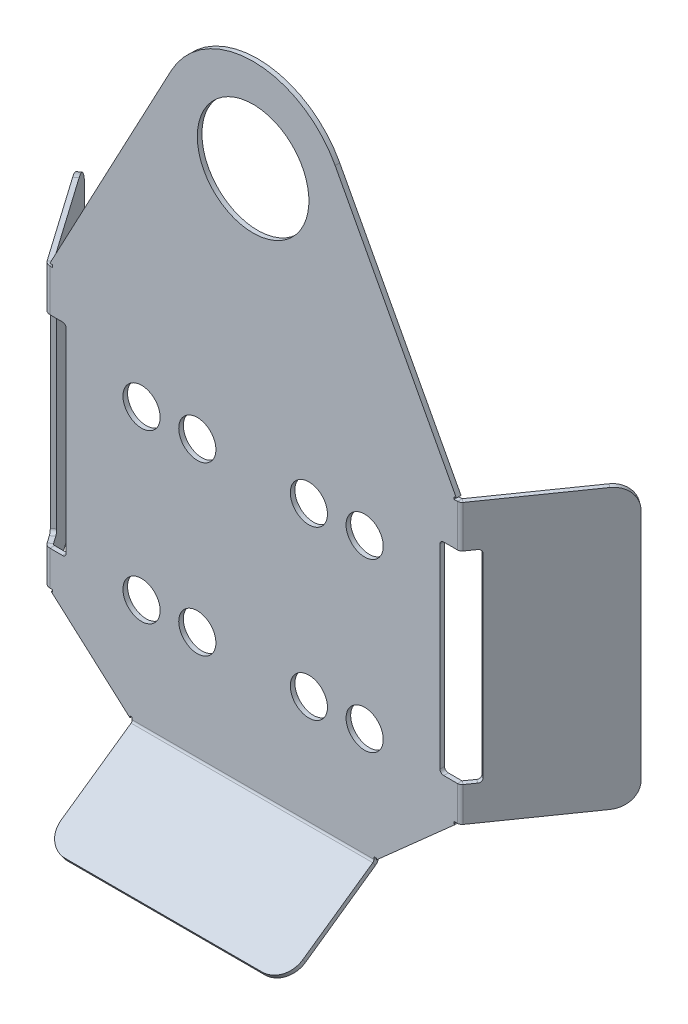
ISO-10303-21;
HEADER;
FILE_DESCRIPTION(('STEP AP214'),'2;1');
FILE_NAME('part.step','',(''),(''),'','','');
FILE_SCHEMA(('AUTOMOTIVE_DESIGN { 1 0 10303 214 1 1 1 1 }'));
ENDSEC;
DATA;
#1=APPLICATION_CONTEXT('core data for automotive mechanical design processes');
#2=APPLICATION_PROTOCOL_DEFINITION('international standard','automotive_design',2000,#1);
#3=PRODUCT_CONTEXT('',#1,'mechanical');
#4=PRODUCT('Part','Part','',(#3));
#5=PRODUCT_RELATED_PRODUCT_CATEGORY('part','',(#4));
#6=PRODUCT_DEFINITION_FORMATION('','',#4);
#7=PRODUCT_DEFINITION_CONTEXT('part definition',#1,'design');
#8=PRODUCT_DEFINITION('design','',#6,#7);
#9=PRODUCT_DEFINITION_SHAPE('','',#8);
#10=(LENGTH_UNIT() NAMED_UNIT(*) SI_UNIT(.MILLI.,.METRE.));
#11=(NAMED_UNIT(*) PLANE_ANGLE_UNIT() SI_UNIT($,.RADIAN.));
#12=(NAMED_UNIT(*) SI_UNIT($,.STERADIAN.) SOLID_ANGLE_UNIT());
#13=UNCERTAINTY_MEASURE_WITH_UNIT(LENGTH_MEASURE(1.E-05),#10,'distance_accuracy_value','');
#14=(GEOMETRIC_REPRESENTATION_CONTEXT(3) GLOBAL_UNCERTAINTY_ASSIGNED_CONTEXT((#13)) GLOBAL_UNIT_ASSIGNED_CONTEXT((#10,
#11,#12)) REPRESENTATION_CONTEXT('',''));
#15=CARTESIAN_POINT('',(0.,0.,0.));
#16=DIRECTION('',(0.,0.,1.));
#17=DIRECTION('',(1.,0.,0.));
#18=AXIS2_PLACEMENT_3D('',#15,#16,#17);
#19=CARTESIAN_POINT('',(83.8899780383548,-48.5528895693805,0.));
#20=DIRECTION('',(0.,0.,-1.));
#21=DIRECTION('',(-1.,0.,0.));
#22=AXIS2_PLACEMENT_3D('',#19,#20,#21);
#23=PLANE('',#22);
#24=CARTESIAN_POINT('',(-30.,-45.,0.));
#25=DIRECTION('',(0.,0.,-1.));
#26=DIRECTION('',(-1.,0.,0.));
#27=AXIS2_PLACEMENT_3D('',#24,#25,#26);
#28=CIRCLE('',#27,5.00000000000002);
#29=CARTESIAN_POINT('',(-35.,-45.,0.));
#30=VERTEX_POINT('',#29);
#31=EDGE_CURVE('E1299',#30,#30,#28,.T.);
#32=ORIENTED_EDGE('',*,*,#31,.T.);
#33=EDGE_LOOP('',(#32));
#34=FACE_BOUND('',#33,.T.);
#35=CARTESIAN_POINT('',(-30.,0.,0.));
#36=DIRECTION('',(0.,0.,-1.));
#37=DIRECTION('',(-1.,0.,0.));
#38=AXIS2_PLACEMENT_3D('',#35,#36,#37);
#39=CIRCLE('',#38,5.00000000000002);
#40=CARTESIAN_POINT('',(-35.,0.,0.));
#41=VERTEX_POINT('',#40);
#42=EDGE_CURVE('E1296',#41,#41,#39,.T.);
#43=ORIENTED_EDGE('',*,*,#42,.T.);
#44=EDGE_LOOP('',(#43));
#45=FACE_BOUND('',#44,.T.);
#46=CARTESIAN_POINT('',(-15.,-45.,0.));
#47=DIRECTION('',(0.,0.,-1.));
#48=DIRECTION('',(-1.,0.,0.));
#49=AXIS2_PLACEMENT_3D('',#46,#47,#48);
#50=CIRCLE('',#49,5.00000000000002);
#51=CARTESIAN_POINT('',(-20.,-45.,0.));
#52=VERTEX_POINT('',#51);
#53=EDGE_CURVE('E1292',#52,#52,#50,.T.);
#54=ORIENTED_EDGE('',*,*,#53,.T.);
#55=EDGE_LOOP('',(#54));
#56=FACE_BOUND('',#55,.T.);
#57=CARTESIAN_POINT('',(-15.,0.,0.));
#58=DIRECTION('',(0.,0.,-1.));
#59=DIRECTION('',(-1.,0.,0.));
#60=AXIS2_PLACEMENT_3D('',#57,#58,#59);
#61=CIRCLE('',#60,5.00000000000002);
#62=CARTESIAN_POINT('',(-20.,0.,0.));
#63=VERTEX_POINT('',#62);
#64=EDGE_CURVE('E1284',#63,#63,#61,.T.);
#65=ORIENTED_EDGE('',*,*,#64,.T.);
#66=EDGE_LOOP('',(#65));
#67=FACE_BOUND('',#66,.T.);
#68=CARTESIAN_POINT('',(15.,-45.,0.));
#69=DIRECTION('',(0.,0.,-1.));
#70=DIRECTION('',(-1.,0.,0.));
#71=AXIS2_PLACEMENT_3D('',#68,#69,#70);
#72=CIRCLE('',#71,5.00000000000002);
#73=CARTESIAN_POINT('',(9.99999999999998,-45.,0.));
#74=VERTEX_POINT('',#73);
#75=EDGE_CURVE('E1280',#74,#74,#72,.T.);
#76=ORIENTED_EDGE('',*,*,#75,.T.);
#77=EDGE_LOOP('',(#76));
#78=FACE_BOUND('',#77,.T.);
#79=CARTESIAN_POINT('',(15.,0.,0.));
#80=DIRECTION('',(0.,0.,-1.));
#81=DIRECTION('',(-1.,0.,0.));
#82=AXIS2_PLACEMENT_3D('',#79,#80,#81);
#83=CIRCLE('',#82,5.00000000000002);
#84=CARTESIAN_POINT('',(9.99999999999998,0.,0.));
#85=VERTEX_POINT('',#84);
#86=EDGE_CURVE('E1276',#85,#85,#83,.T.);
#87=ORIENTED_EDGE('',*,*,#86,.T.);
#88=EDGE_LOOP('',(#87));
#89=FACE_BOUND('',#88,.T.);
#90=CARTESIAN_POINT('',(30.,-45.,0.));
#91=DIRECTION('',(0.,0.,-1.));
#92=DIRECTION('',(-1.,0.,0.));
#93=AXIS2_PLACEMENT_3D('',#90,#91,#92);
#94=CIRCLE('',#93,5.00000000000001);
#95=CARTESIAN_POINT('',(25.,-45.,0.));
#96=VERTEX_POINT('',#95);
#97=EDGE_CURVE('E1273',#96,#96,#94,.T.);
#98=ORIENTED_EDGE('',*,*,#97,.T.);
#99=EDGE_LOOP('',(#98));
#100=FACE_BOUND('',#99,.T.);
#101=CARTESIAN_POINT('',(30.,0.,0.));
#102=DIRECTION('',(0.,0.,-1.));
#103=DIRECTION('',(-1.,0.,0.));
#104=AXIS2_PLACEMENT_3D('',#101,#102,#103);
#105=CIRCLE('',#104,5.00000000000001);
#106=CARTESIAN_POINT('',(25.,0.,0.));
#107=VERTEX_POINT('',#106);
#108=EDGE_CURVE('E1265',#107,#107,#105,.T.);
#109=ORIENTED_EDGE('',*,*,#108,.T.);
#110=EDGE_LOOP('',(#109));
#111=FACE_BOUND('',#110,.T.);
#112=CARTESIAN_POINT('',(0.,70.4471104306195,0.));
#113=DIRECTION('',(0.,0.,-1.));
#114=DIRECTION('',(-1.,0.,0.));
#115=AXIS2_PLACEMENT_3D('',#112,#113,#114);
#116=CIRCLE('',#115,15.);
#117=CARTESIAN_POINT('',(-15.,70.4471104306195,0.));
#118=VERTEX_POINT('',#117);
#119=EDGE_CURVE('E1261',#118,#118,#116,.T.);
#120=ORIENTED_EDGE('',*,*,#119,.T.);
#121=EDGE_LOOP('',(#120));
#122=FACE_BOUND('',#121,.T.);
#123=DIRECTION('',(0.,1.,0.));
#124=VECTOR('',#123,1.);
#125=CARTESIAN_POINT('',(-32.5,-98.4428676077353,0.));
#126=LINE('',#125,#124);
#127=CARTESIAN_POINT('',(-32.5,-74.1694398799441,0.));
#128=VERTEX_POINT('',#127);
#129=CARTESIAN_POINT('',(-32.5,-73.5511398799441,0.));
#130=VERTEX_POINT('',#129);
#131=EDGE_CURVE('E61',#128,#130,#126,.T.);
#132=ORIENTED_EDGE('',*,*,#131,.F.);
#133=DIRECTION('',(1.,0.,0.));
#134=VECTOR('',#133,1.);
#135=CARTESIAN_POINT('',(83.8899780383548,-74.1694398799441,0.));
#136=LINE('',#135,#134);
#137=CARTESIAN_POINT('',(32.5,-74.1694398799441,0.));
#138=VERTEX_POINT('',#137);
#139=EDGE_CURVE('E676',#128,#138,#136,.T.);
#140=ORIENTED_EDGE('',*,*,#139,.T.);
#141=DIRECTION('',(0.,-1.,0.));
#142=VECTOR('',#141,1.);
#143=CARTESIAN_POINT('',(32.5,-73.5511398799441,0.));
#144=LINE('',#143,#142);
#145=CARTESIAN_POINT('',(32.5,-73.5511398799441,0.));
#146=VERTEX_POINT('',#145);
#147=EDGE_CURVE('E882',#146,#138,#144,.T.);
#148=ORIENTED_EDGE('',*,*,#147,.F.);
#149=DIRECTION('',(-1.,0.,0.));
#150=VECTOR('',#149,1.);
#151=CARTESIAN_POINT('',(33.1183,-73.5511398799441,0.));
#152=LINE('',#151,#150);
#153=CARTESIAN_POINT('',(33.1183,-73.5511398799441,0.));
#154=VERTEX_POINT('',#153);
#155=EDGE_CURVE('E906',#154,#146,#152,.T.);
#156=ORIENTED_EDGE('',*,*,#155,.F.);
#157=DIRECTION('',(0.,1.,0.));
#158=VECTOR('',#157,1.);
#159=CARTESIAN_POINT('',(33.1183,-74.0032895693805,0.));
#160=LINE('',#159,#158);
#161=CARTESIAN_POINT('',(33.1183,-74.0032895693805,0.));
#162=VERTEX_POINT('',#161);
#163=EDGE_CURVE('E913',#162,#154,#160,.T.);
#164=ORIENTED_EDGE('',*,*,#163,.F.);
#165=DIRECTION('',(-0.74740931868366,-0.66436383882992,0.));
#166=VECTOR('',#165,1.);
#167=CARTESIAN_POINT('',(54.3044125,-55.1711895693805,0.));
#168=LINE('',#167,#166);
#169=CARTESIAN_POINT('',(54.3044125,-55.1711895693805,0.));
#170=VERTEX_POINT('',#169);
#171=EDGE_CURVE('E944',#170,#162,#168,.T.);
#172=ORIENTED_EDGE('',*,*,#171,.F.);
#173=DIRECTION('',(1.,0.,0.));
#174=VECTOR('',#173,1.);
#175=CARTESIAN_POINT('',(53.9982503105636,-55.1711895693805,0.));
#176=LINE('',#175,#174);
#177=CARTESIAN_POINT('',(53.9982503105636,-55.1711895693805,0.));
#178=VERTEX_POINT('',#177);
#179=EDGE_CURVE('E955',#178,#170,#176,.T.);
#180=ORIENTED_EDGE('',*,*,#179,.F.);
#181=DIRECTION('',(0.,-1.,0.));
#182=VECTOR('',#181,1.);
#183=CARTESIAN_POINT('',(53.9982503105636,-54.5528895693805,0.));
#184=LINE('',#183,#182);
#185=CARTESIAN_POINT('',(53.9982503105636,-54.5528895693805,0.));
#186=VERTEX_POINT('',#185);
#187=EDGE_CURVE('E961',#186,#178,#184,.T.);
#188=ORIENTED_EDGE('',*,*,#187,.F.);
#189=DIRECTION('',(-1.,0.,0.));
#190=VECTOR('',#189,1.);
#191=CARTESIAN_POINT('',(83.8899780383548,-54.5528895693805,0.));
#192=LINE('',#191,#190);
#193=CARTESIAN_POINT('',(54.9700929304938,-54.5528895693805,0.));
#194=VERTEX_POINT('',#193);
#195=EDGE_CURVE('E1504',#194,#186,#192,.T.);
#196=ORIENTED_EDGE('',*,*,#195,.F.);
#197=DIRECTION('',(0.,1.,0.));
#198=VECTOR('',#197,1.);
#199=CARTESIAN_POINT('',(54.9700929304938,-48.5528895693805,0.));
#200=LINE('',#199,#198);
#201=CARTESIAN_POINT('',(54.9700929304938,-45.2607609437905,0.));
#202=VERTEX_POINT('',#201);
#203=EDGE_CURVE('E694',#194,#202,#200,.T.);
#204=ORIENTED_EDGE('',*,*,#203,.T.);
#205=DIRECTION('',(-1.,0.,0.));
#206=VECTOR('',#205,1.);
#207=CARTESIAN_POINT('',(58.3863750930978,-45.2607609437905,0.));
#208=LINE('',#207,#206);
#209=CARTESIAN_POINT('',(51.2548180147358,-45.2607609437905,0.));
#210=VERTEX_POINT('',#209);
#211=EDGE_CURVE('E1260',#202,#210,#208,.T.);
#212=ORIENTED_EDGE('',*,*,#211,.T.);
#213=CARTESIAN_POINT('',(51.2548180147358,-44.2607609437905,0.));
#214=DIRECTION('',(0.,0.,-1.));
#215=DIRECTION('',(-1.,0.,0.));
#216=AXIS2_PLACEMENT_3D('',#213,#214,#215);
#217=CIRCLE('',#216,1.);
#218=CARTESIAN_POINT('',(50.2548180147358,-44.2607609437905,0.));
#219=VERTEX_POINT('',#218);
#220=EDGE_CURVE('E1256',#210,#219,#217,.T.);
#221=ORIENTED_EDGE('',*,*,#220,.T.);
#222=DIRECTION('',(0.,1.,0.));
#223=VECTOR('',#222,1.);
#224=CARTESIAN_POINT('',(50.2548180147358,-44.2607609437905,0.));
#225=LINE('',#224,#223);
#226=CARTESIAN_POINT('',(50.2548180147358,8.12118616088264,0.));
#227=VERTEX_POINT('',#226);
#228=EDGE_CURVE('E1247',#219,#227,#225,.T.);
#229=ORIENTED_EDGE('',*,*,#228,.T.);
#230=CARTESIAN_POINT('',(51.2548180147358,8.12118616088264,0.));
#231=DIRECTION('',(0.,0.,-1.));
#232=DIRECTION('',(-1.,0.,0.));
#233=AXIS2_PLACEMENT_3D('',#230,#231,#232);
#234=CIRCLE('',#233,1.);
#235=CARTESIAN_POINT('',(51.2548180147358,9.12118616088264,0.));
#236=VERTEX_POINT('',#235);
#237=EDGE_CURVE('E1243',#227,#236,#234,.T.);
#238=ORIENTED_EDGE('',*,*,#237,.T.);
#239=DIRECTION('',(1.,0.,0.));
#240=VECTOR('',#239,1.);
#241=CARTESIAN_POINT('',(51.2548180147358,9.12118616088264,0.));
#242=LINE('',#241,#240);
#243=CARTESIAN_POINT('',(54.9700929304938,9.12118616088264,0.));
#244=VERTEX_POINT('',#243);
#245=EDGE_CURVE('E869',#236,#244,#242,.T.);
#246=ORIENTED_EDGE('',*,*,#245,.T.);
#247=DIRECTION('',(0.,1.,0.));
#248=VECTOR('',#247,1.);
#249=CARTESIAN_POINT('',(54.9700929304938,-48.5528895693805,0.));
#250=LINE('',#249,#248);
#251=CARTESIAN_POINT('',(54.9700929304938,20.4471104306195,0.));
#252=VERTEX_POINT('',#251);
#253=EDGE_CURVE('E703',#244,#252,#250,.T.);
#254=ORIENTED_EDGE('',*,*,#253,.T.);
#255=DIRECTION('',(1.,0.,0.));
#256=VECTOR('',#255,1.);
#257=CARTESIAN_POINT('',(53.9982503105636,20.4471104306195,0.));
#258=LINE('',#257,#256);
#259=CARTESIAN_POINT('',(53.9982503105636,20.4471104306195,0.));
#260=VERTEX_POINT('',#259);
#261=EDGE_CURVE('E987',#260,#252,#258,.T.);
#262=ORIENTED_EDGE('',*,*,#261,.F.);
#263=DIRECTION('',(0.,-1.,0.));
#264=VECTOR('',#263,1.);
#265=CARTESIAN_POINT('',(53.9982503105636,21.0654104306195,0.));
#266=LINE('',#265,#264);
#267=CARTESIAN_POINT('',(53.9982503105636,21.0654104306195,0.));
#268=VERTEX_POINT('',#267);
#269=EDGE_CURVE('E988',#268,#260,#266,.T.);
#270=ORIENTED_EDGE('',*,*,#269,.F.);
#271=DIRECTION('',(-1.,0.,0.));
#272=VECTOR('',#271,1.);
#273=CARTESIAN_POINT('',(54.67024,21.0654104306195,0.));
#274=LINE('',#273,#272);
#275=CARTESIAN_POINT('',(54.67024,21.0654104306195,0.));
#276=VERTEX_POINT('',#275);
#277=EDGE_CURVE('E1004',#276,#268,#274,.T.);
#278=ORIENTED_EDGE('',*,*,#277,.F.);
#279=DIRECTION('',(0.470588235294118,-0.88235294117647,0.));
#280=VECTOR('',#279,1.);
#281=CARTESIAN_POINT('',(22.0588235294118,82.2118163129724,0.));
#282=LINE('',#281,#280);
#283=CARTESIAN_POINT('',(22.0588235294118,82.2118163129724,0.));
#284=VERTEX_POINT('',#283);
#285=EDGE_CURVE('E1010',#284,#276,#282,.T.);
#286=ORIENTED_EDGE('',*,*,#285,.F.);
#287=CARTESIAN_POINT('',(0.,70.4471104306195,0.));
#288=DIRECTION('',(0.,0.,-1.));
#289=DIRECTION('',(-1.,0.,0.));
#290=AXIS2_PLACEMENT_3D('',#287,#288,#289);
#291=CIRCLE('',#290,25.);
#292=CARTESIAN_POINT('',(-22.0588235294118,82.2118163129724,0.));
#293=VERTEX_POINT('',#292);
#294=EDGE_CURVE('E1034',#293,#284,#291,.T.);
#295=ORIENTED_EDGE('',*,*,#294,.F.);
#296=DIRECTION('',(0.470588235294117,0.882352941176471,0.));
#297=VECTOR('',#296,1.);
#298=CARTESIAN_POINT('',(-54.67024,21.0654104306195,0.));
#299=LINE('',#298,#297);
#300=CARTESIAN_POINT('',(-54.67024,21.0654104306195,0.));
#301=VERTEX_POINT('',#300);
#302=EDGE_CURVE('E1035',#301,#293,#299,.T.);
#303=ORIENTED_EDGE('',*,*,#302,.F.);
#304=DIRECTION('',(-1.,0.,0.));
#305=VECTOR('',#304,1.);
#306=CARTESIAN_POINT('',(-53.9982503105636,21.0654104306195,0.));
#307=LINE('',#306,#305);
#308=CARTESIAN_POINT('',(-53.9982503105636,21.0654104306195,0.));
#309=VERTEX_POINT('',#308);
#310=EDGE_CURVE('E1048',#309,#301,#307,.T.);
#311=ORIENTED_EDGE('',*,*,#310,.F.);
#312=DIRECTION('',(0.,1.,0.));
#313=VECTOR('',#312,1.);
#314=CARTESIAN_POINT('',(-53.9982503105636,20.4471104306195,0.));
#315=LINE('',#314,#313);
#316=CARTESIAN_POINT('',(-53.9982503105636,20.4471104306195,0.));
#317=VERTEX_POINT('',#316);
#318=EDGE_CURVE('E1053',#317,#309,#315,.T.);
#319=ORIENTED_EDGE('',*,*,#318,.F.);
#320=DIRECTION('',(1.,0.,0.));
#321=VECTOR('',#320,1.);
#322=CARTESIAN_POINT('',(-83.8899780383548,20.4471104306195,0.));
#323=LINE('',#322,#321);
#324=CARTESIAN_POINT('',(-54.6165503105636,20.4471104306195,0.));
#325=VERTEX_POINT('',#324);
#326=EDGE_CURVE('E631',#325,#317,#323,.T.);
#327=ORIENTED_EDGE('',*,*,#326,.F.);
#328=DIRECTION('',(0.,1.,0.));
#329=VECTOR('',#328,1.);
#330=CARTESIAN_POINT('',(-54.6165503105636,-48.5528895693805,0.));
#331=LINE('',#330,#329);
#332=CARTESIAN_POINT('',(-54.6165503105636,9.12118616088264,0.));
#333=VERTEX_POINT('',#332);
#334=EDGE_CURVE('E1100',#333,#325,#331,.T.);
#335=ORIENTED_EDGE('',*,*,#334,.F.);
#336=DIRECTION('',(-1.,0.,0.));
#337=VECTOR('',#336,1.);
#338=CARTESIAN_POINT('',(-51.2548180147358,9.12118616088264,0.));
#339=LINE('',#338,#337);
#340=CARTESIAN_POINT('',(-51.2548180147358,9.12118616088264,0.));
#341=VERTEX_POINT('',#340);
#342=EDGE_CURVE('E1098',#341,#333,#339,.T.);
#343=ORIENTED_EDGE('',*,*,#342,.F.);
#344=CARTESIAN_POINT('',(-51.2548180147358,8.12118616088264,0.));
#345=DIRECTION('',(0.,0.,1.));
#346=DIRECTION('',(1.,0.,0.));
#347=AXIS2_PLACEMENT_3D('',#344,#345,#346);
#348=CIRCLE('',#347,1.);
#349=CARTESIAN_POINT('',(-50.2548180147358,8.12118616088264,0.));
#350=VERTEX_POINT('',#349);
#351=EDGE_CURVE('E780',#350,#341,#348,.T.);
#352=ORIENTED_EDGE('',*,*,#351,.F.);
#353=DIRECTION('',(0.,1.,0.));
#354=VECTOR('',#353,1.);
#355=CARTESIAN_POINT('',(-50.2548180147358,-44.2607609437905,0.));
#356=LINE('',#355,#354);
#357=CARTESIAN_POINT('',(-50.2548180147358,-44.2607609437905,0.));
#358=VERTEX_POINT('',#357);
#359=EDGE_CURVE('E781',#358,#350,#356,.T.);
#360=ORIENTED_EDGE('',*,*,#359,.F.);
#361=CARTESIAN_POINT('',(-51.2548180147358,-44.2607609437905,0.));
#362=DIRECTION('',(0.,0.,1.));
#363=DIRECTION('',(1.,0.,0.));
#364=AXIS2_PLACEMENT_3D('',#361,#362,#363);
#365=CIRCLE('',#364,1.);
#366=CARTESIAN_POINT('',(-51.2548180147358,-45.2607609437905,0.));
#367=VERTEX_POINT('',#366);
#368=EDGE_CURVE('E796',#367,#358,#365,.T.);
#369=ORIENTED_EDGE('',*,*,#368,.F.);
#370=DIRECTION('',(1.,0.,0.));
#371=VECTOR('',#370,1.);
#372=CARTESIAN_POINT('',(-58.3863750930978,-45.2607609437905,0.));
#373=LINE('',#372,#371);
#374=CARTESIAN_POINT('',(-54.6165503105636,-45.2607609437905,0.));
#375=VERTEX_POINT('',#374);
#376=EDGE_CURVE('E1106',#375,#367,#373,.T.);
#377=ORIENTED_EDGE('',*,*,#376,.F.);
#378=DIRECTION('',(0.,1.,0.));
#379=VECTOR('',#378,1.);
#380=CARTESIAN_POINT('',(-54.6165503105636,-48.5528895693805,0.));
#381=LINE('',#380,#379);
#382=CARTESIAN_POINT('',(-54.6165503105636,-54.5528895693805,0.));
#383=VERTEX_POINT('',#382);
#384=EDGE_CURVE('E1229',#383,#375,#381,.T.);
#385=ORIENTED_EDGE('',*,*,#384,.F.);
#386=DIRECTION('',(-1.,0.,0.));
#387=VECTOR('',#386,1.);
#388=CARTESIAN_POINT('',(-53.9982503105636,-54.5528895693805,0.));
#389=LINE('',#388,#387);
#390=CARTESIAN_POINT('',(-53.9982503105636,-54.5528895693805,0.));
#391=VERTEX_POINT('',#390);
#392=EDGE_CURVE('E1236',#391,#383,#389,.T.);
#393=ORIENTED_EDGE('',*,*,#392,.F.);
#394=DIRECTION('',(0.,1.,0.));
#395=VECTOR('',#394,1.);
#396=CARTESIAN_POINT('',(-53.9982503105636,-55.1711895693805,0.));
#397=LINE('',#396,#395);
#398=CARTESIAN_POINT('',(-53.9982503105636,-55.1711895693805,0.));
#399=VERTEX_POINT('',#398);
#400=EDGE_CURVE('E1304',#399,#391,#397,.T.);
#401=ORIENTED_EDGE('',*,*,#400,.F.);
#402=DIRECTION('',(1.,0.,0.));
#403=VECTOR('',#402,1.);
#404=CARTESIAN_POINT('',(-54.3044125,-55.1711895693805,0.));
#405=LINE('',#404,#403);
#406=CARTESIAN_POINT('',(-54.3044125,-55.1711895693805,0.));
#407=VERTEX_POINT('',#406);
#408=EDGE_CURVE('E2810',#407,#399,#405,.T.);
#409=ORIENTED_EDGE('',*,*,#408,.F.);
#410=DIRECTION('',(-0.74740931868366,0.66436383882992,0.));
#411=VECTOR('',#410,1.);
#412=CARTESIAN_POINT('',(-33.1183,-74.0032895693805,0.));
#413=LINE('',#412,#411);
#414=CARTESIAN_POINT('',(-33.1183,-74.0032895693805,0.));
#415=VERTEX_POINT('',#414);
#416=EDGE_CURVE('E2801',#415,#407,#413,.T.);
#417=ORIENTED_EDGE('',*,*,#416,.F.);
#418=DIRECTION('',(0.,-1.,0.));
#419=VECTOR('',#418,1.);
#420=CARTESIAN_POINT('',(-33.1183,-73.5511398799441,0.));
#421=LINE('',#420,#419);
#422=CARTESIAN_POINT('',(-33.1183,-73.5511398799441,0.));
#423=VERTEX_POINT('',#422);
#424=EDGE_CURVE('E2802',#423,#415,#421,.T.);
#425=ORIENTED_EDGE('',*,*,#424,.F.);
#426=DIRECTION('',(-1.,0.,0.));
#427=VECTOR('',#426,1.);
#428=CARTESIAN_POINT('',(-32.5,-73.5511398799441,0.));
#429=LINE('',#428,#427);
#430=EDGE_CURVE('E902',#130,#423,#429,.T.);
#431=ORIENTED_EDGE('',*,*,#430,.F.);
#432=EDGE_LOOP('',(#132,#140,#148,#156,#164,#172,#180,#188,#196,#204,#212,#221,#229,#238,#246,
#254,#262,#270,#278,#286,#295,#303,#311,#319,#327,#335,#343,#352,#360,#369,#377,#385,#393,#401,
#409,#417,#425,#431));
#433=FACE_BOUND('',#432,.T.);
#434=ADVANCED_FACE('F57',(#34,#45,#56,#67,#78,#89,#100,#111,#122,#433),#23,.F.);
#435=CARTESIAN_POINT('',(58.3863750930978,-45.2607609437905,0.));
#436=DIRECTION('',(0.,-1.,0.));
#437=DIRECTION('',(0.,0.,-1.));
#438=AXIS2_PLACEMENT_3D('',#435,#436,#437);
#439=PLANE('',#438);
#440=ORIENTED_EDGE('',*,*,#211,.F.);
#441=DIRECTION('',(0.,0.,-1.));
#442=VECTOR('',#441,1.);
#443=CARTESIAN_POINT('',(54.9700929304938,-45.2607609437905,0.));
#444=LINE('',#443,#442);
#445=CARTESIAN_POINT('',(54.9700929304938,-45.2607609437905,-1.2366));
#446=VERTEX_POINT('',#445);
#447=EDGE_CURVE('E700',#202,#446,#444,.T.);
#448=ORIENTED_EDGE('',*,*,#447,.T.);
#449=DIRECTION('',(-1.,0.,0.));
#450=VECTOR('',#449,1.);
#451=CARTESIAN_POINT('',(58.3863750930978,-45.2607609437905,-1.2366));
#452=LINE('',#451,#450);
#453=CARTESIAN_POINT('',(51.2548180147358,-45.2607609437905,-1.2366));
#454=VERTEX_POINT('',#453);
#455=EDGE_CURVE('E677',#446,#454,#452,.T.);
#456=ORIENTED_EDGE('',*,*,#455,.T.);
#457=DIRECTION('',(0.,0.,-1.));
#458=VECTOR('',#457,1.);
#459=CARTESIAN_POINT('',(51.2548180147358,-45.2607609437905,0.));
#460=LINE('',#459,#458);
#461=EDGE_CURVE('E714',#210,#454,#460,.T.);
#462=ORIENTED_EDGE('',*,*,#461,.F.);
#463=EDGE_LOOP('',(#440,#448,#456,#462));
#464=FACE_BOUND('',#463,.T.);
#465=ADVANCED_FACE('F823',(#464),#439,.F.);
#466=CARTESIAN_POINT('',(51.2548180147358,9.12118616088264,0.));
#467=DIRECTION('',(0.,1.,0.));
#468=DIRECTION('',(0.,0.,1.));
#469=AXIS2_PLACEMENT_3D('',#466,#467,#468);
#470=PLANE('',#469);
#471=DIRECTION('',(1.,0.,0.));
#472=VECTOR('',#471,1.);
#473=CARTESIAN_POINT('',(51.2548180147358,9.12118616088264,-1.2366));
#474=LINE('',#473,#472);
#475=CARTESIAN_POINT('',(51.2548180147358,9.12118616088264,-1.2366));
#476=VERTEX_POINT('',#475);
#477=CARTESIAN_POINT('',(54.9700929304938,9.12118616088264,-1.2366));
#478=VERTEX_POINT('',#477);
#479=EDGE_CURVE('E1226',#476,#478,#474,.T.);
#480=ORIENTED_EDGE('',*,*,#479,.T.);
#481=DIRECTION('',(0.,0.,1.));
#482=VECTOR('',#481,1.);
#483=CARTESIAN_POINT('',(54.9700929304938,9.12118616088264,0.));
#484=LINE('',#483,#482);
#485=EDGE_CURVE('E670',#478,#244,#484,.T.);
#486=ORIENTED_EDGE('',*,*,#485,.T.);
#487=ORIENTED_EDGE('',*,*,#245,.F.);
#488=DIRECTION('',(0.,0.,-1.));
#489=VECTOR('',#488,1.);
#490=CARTESIAN_POINT('',(51.2548180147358,9.12118616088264,0.));
#491=LINE('',#490,#489);
#492=EDGE_CURVE('E1222',#236,#476,#491,.T.);
#493=ORIENTED_EDGE('',*,*,#492,.T.);
#494=EDGE_LOOP('',(#480,#486,#487,#493));
#495=FACE_BOUND('',#494,.T.);
#496=ADVANCED_FACE('F829',(#495),#470,.F.);
#497=CARTESIAN_POINT('',(-52.5457276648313,9.12118616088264,2.26846414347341));
#498=DIRECTION('',(0.,1.,0.));
#499=DIRECTION('',(-0.819152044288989,0.,0.57357643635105));
#500=AXIS2_PLACEMENT_3D('',#497,#498,#499);
#501=PLANE('',#500);
#502=DIRECTION('',(-0.57357643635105,0.,-0.819152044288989));
#503=VECTOR('',#502,1.);
#504=CARTESIAN_POINT('',(-52.5457276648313,9.12118616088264,2.26846414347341));
#505=LINE('',#504,#503);
#506=CARTESIAN_POINT('',(-55.2199377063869,9.12118616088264,-1.55070359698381));
#507=VERTEX_POINT('',#506);
#508=CARTESIAN_POINT('',(-56.6362207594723,9.12118616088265,-3.57336541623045));
#509=VERTEX_POINT('',#508);
#510=EDGE_CURVE('E1123',#507,#509,#505,.T.);
#511=ORIENTED_EDGE('',*,*,#510,.F.);
#512=DIRECTION('',(-0.819152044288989,0.,0.57357643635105));
#513=VECTOR('',#512,1.);
#514=CARTESIAN_POINT('',(-55.2199377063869,9.12118616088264,-1.55070359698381));
#515=LINE('',#514,#513);
#516=CARTESIAN_POINT('',(-56.2329011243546,9.12118616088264,-0.841418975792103));
#517=VERTEX_POINT('',#516);
#518=EDGE_CURVE('E1160',#507,#517,#515,.T.);
#519=ORIENTED_EDGE('',*,*,#518,.T.);
#520=DIRECTION('',(-0.57357643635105,0.,-0.819152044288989));
#521=VECTOR('',#520,1.);
#522=CARTESIAN_POINT('',(-53.5586910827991,9.12118616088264,2.97774876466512));
#523=LINE('',#522,#521);
#524=CARTESIAN_POINT('',(-57.6491841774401,9.12118616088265,-2.86408079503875));
#525=VERTEX_POINT('',#524);
#526=EDGE_CURVE('E630',#517,#525,#523,.T.);
#527=ORIENTED_EDGE('',*,*,#526,.T.);
#528=DIRECTION('',(-0.819152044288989,0.,0.57357643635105));
#529=VECTOR('',#528,1.);
#530=CARTESIAN_POINT('',(-56.6362207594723,9.12118616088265,-3.57336541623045));
#531=LINE('',#530,#529);
#532=EDGE_CURVE('E1211',#509,#525,#531,.T.);
#533=ORIENTED_EDGE('',*,*,#532,.F.);
#534=EDGE_LOOP('',(#511,#519,#527,#533));
#535=FACE_BOUND('',#534,.T.);
#536=ADVANCED_FACE('F1420',(#535),#501,.F.);
#537=CARTESIAN_POINT('',(-56.6362207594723,-45.2607609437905,-3.57336541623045));
#538=DIRECTION('',(0.,-1.,0.));
#539=DIRECTION('',(0.819152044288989,0.,-0.57357643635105));
#540=AXIS2_PLACEMENT_3D('',#537,#538,#539);
#541=PLANE('',#540);
#542=DIRECTION('',(0.57357643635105,0.,0.819152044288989));
#543=VECTOR('',#542,1.);
#544=CARTESIAN_POINT('',(-57.6491841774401,-45.2607609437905,-2.86408079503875));
#545=LINE('',#544,#543);
#546=CARTESIAN_POINT('',(-57.6491841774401,-45.2607609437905,-2.86408079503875));
#547=VERTEX_POINT('',#546);
#548=CARTESIAN_POINT('',(-56.2329011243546,-45.2607609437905,-0.841418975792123));
#549=VERTEX_POINT('',#548);
#550=EDGE_CURVE('E1179',#547,#549,#545,.T.);
#551=ORIENTED_EDGE('',*,*,#550,.T.);
#552=DIRECTION('',(0.819152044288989,0.,-0.57357643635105));
#553=VECTOR('',#552,1.);
#554=CARTESIAN_POINT('',(-55.2199377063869,-45.2607609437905,-1.55070359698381));
#555=LINE('',#554,#553);
#556=CARTESIAN_POINT('',(-55.2199377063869,-45.2607609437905,-1.55070359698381));
#557=VERTEX_POINT('',#556);
#558=EDGE_CURVE('E1161',#549,#557,#555,.T.);
#559=ORIENTED_EDGE('',*,*,#558,.T.);
#560=DIRECTION('',(0.57357643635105,0.,0.819152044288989));
#561=VECTOR('',#560,1.);
#562=CARTESIAN_POINT('',(-56.6362207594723,-45.2607609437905,-3.57336541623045));
#563=LINE('',#562,#561);
#564=CARTESIAN_POINT('',(-56.6362207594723,-45.2607609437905,-3.57336541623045));
#565=VERTEX_POINT('',#564);
#566=EDGE_CURVE('E1139',#565,#557,#563,.T.);
#567=ORIENTED_EDGE('',*,*,#566,.F.);
#568=DIRECTION('',(-0.819152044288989,0.,0.57357643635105));
#569=VECTOR('',#568,1.);
#570=CARTESIAN_POINT('',(-56.6362207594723,-45.2607609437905,-3.57336541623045));
#571=LINE('',#570,#569);
#572=EDGE_CURVE('E1201',#565,#547,#571,.T.);
#573=ORIENTED_EDGE('',*,*,#572,.T.);
#574=EDGE_LOOP('',(#551,#559,#567,#573));
#575=FACE_BOUND('',#574,.T.);
#576=ADVANCED_FACE('F1440',(#575),#541,.F.);
#577=CARTESIAN_POINT('',(23.957179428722,-48.5528895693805,113.681884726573));
#578=DIRECTION('',(0.819152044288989,0.,-0.57357643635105));
#579=DIRECTION('',(-0.57357643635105,0.,-0.819152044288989));
#580=AXIS2_PLACEMENT_3D('',#577,#578,#579);
#581=PLANE('',#580);
#582=DIRECTION('',(-0.57357643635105,0.,-0.819152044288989));
#583=VECTOR('',#582,1.);
#584=CARTESIAN_POINT('',(-55.1322592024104,-54.5528895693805,0.730460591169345));
#585=LINE('',#584,#583);
#586=CARTESIAN_POINT('',(-56.2329011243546,-54.5528895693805,-0.841418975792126));
#587=VERTEX_POINT('',#586);
#588=CARTESIAN_POINT('',(-72.2774498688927,-54.5528895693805,-23.7554092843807));
#589=VERTEX_POINT('',#588);
#590=EDGE_CURVE('E1361',#587,#589,#585,.T.);
#591=ORIENTED_EDGE('',*,*,#590,.F.);
#592=DIRECTION('',(0.,1.,0.));
#593=VECTOR('',#592,1.);
#594=CARTESIAN_POINT('',(-56.2329011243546,-48.5528895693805,-0.84141897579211));
#595=LINE('',#594,#593);
#596=EDGE_CURVE('E1332',#587,#549,#595,.T.);
#597=ORIENTED_EDGE('',*,*,#596,.T.);
#598=ORIENTED_EDGE('',*,*,#550,.F.);
#599=CARTESIAN_POINT('',(-57.6491841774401,-44.2607609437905,-2.86408079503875));
#600=DIRECTION('',(-0.819152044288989,0.,0.57357643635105));
#601=DIRECTION('',(0.57357643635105,0.,0.819152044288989));
#602=AXIS2_PLACEMENT_3D('',#599,#600,#601);
#603=CIRCLE('',#602,1.00000000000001);
#604=CARTESIAN_POINT('',(-58.2227606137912,-44.2607609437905,-3.68323283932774));
#605=VERTEX_POINT('',#604);
#606=EDGE_CURVE('E1190',#605,#547,#603,.T.);
#607=ORIENTED_EDGE('',*,*,#606,.F.);
#608=DIRECTION('',(0.,-1.,0.));
#609=VECTOR('',#608,1.);
#610=CARTESIAN_POINT('',(-58.2227606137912,8.12118616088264,-3.68323283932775));
#611=LINE('',#610,#609);
#612=CARTESIAN_POINT('',(-58.2227606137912,8.12118616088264,-3.68323283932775));
#613=VERTEX_POINT('',#612);
#614=EDGE_CURVE('E1144',#613,#605,#611,.T.);
#615=ORIENTED_EDGE('',*,*,#614,.F.);
#616=CARTESIAN_POINT('',(-57.6491841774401,8.12118616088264,-2.86408079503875));
#617=DIRECTION('',(-0.819152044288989,0.,0.57357643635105));
#618=DIRECTION('',(0.57357643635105,0.,0.819152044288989));
#619=AXIS2_PLACEMENT_3D('',#616,#617,#618);
#620=CIRCLE('',#619,1.00000000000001);
#621=EDGE_CURVE('E1140',#525,#613,#620,.T.);
#622=ORIENTED_EDGE('',*,*,#621,.F.);
#623=ORIENTED_EDGE('',*,*,#526,.F.);
#624=DIRECTION('',(0.,1.,0.));
#625=VECTOR('',#624,1.);
#626=CARTESIAN_POINT('',(-56.2329011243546,-48.5528895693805,-0.84141897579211));
#627=LINE('',#626,#625);
#628=CARTESIAN_POINT('',(-56.2329011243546,20.4471104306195,-0.841418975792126));
#629=VERTEX_POINT('',#628);
#630=EDGE_CURVE('E1155',#517,#629,#627,.T.);
#631=ORIENTED_EDGE('',*,*,#630,.T.);
#632=DIRECTION('',(0.57357643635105,0.,0.819152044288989));
#633=VECTOR('',#632,1.);
#634=CARTESIAN_POINT('',(-72.2774498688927,20.4471104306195,-23.7554092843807));
#635=LINE('',#634,#633);
#636=CARTESIAN_POINT('',(-72.2774498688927,20.4471104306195,-23.7554092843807));
#637=VERTEX_POINT('',#636);
#638=EDGE_CURVE('E1182',#637,#629,#635,.T.);
#639=ORIENTED_EDGE('',*,*,#638,.F.);
#640=CARTESIAN_POINT('',(-72.2774498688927,14.4471104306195,-23.7554092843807));
#641=DIRECTION('',(0.819152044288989,0.,-0.57357643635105));
#642=DIRECTION('',(-0.57357643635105,0.,-0.819152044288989));
#643=AXIS2_PLACEMENT_3D('',#640,#641,#642);
#644=CIRCLE('',#643,6.00000000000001);
#645=CARTESIAN_POINT('',(-75.7189084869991,14.4471104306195,-28.6703215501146));
#646=VERTEX_POINT('',#645);
#647=EDGE_CURVE('E1186',#646,#637,#644,.T.);
#648=ORIENTED_EDGE('',*,*,#647,.F.);
#649=DIRECTION('',(0.,1.,0.));
#650=VECTOR('',#649,1.);
#651=CARTESIAN_POINT('',(-75.7189084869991,-48.5528895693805,-28.6703215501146));
#652=LINE('',#651,#650);
#653=CARTESIAN_POINT('',(-75.7189084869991,-48.5528895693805,-28.6703215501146));
#654=VERTEX_POINT('',#653);
#655=EDGE_CURVE('E1369',#654,#646,#652,.T.);
#656=ORIENTED_EDGE('',*,*,#655,.F.);
#657=CARTESIAN_POINT('',(-72.2774498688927,-48.5528895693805,-23.7554092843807));
#658=DIRECTION('',(0.819152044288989,0.,-0.57357643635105));
#659=DIRECTION('',(-0.57357643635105,0.,-0.819152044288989));
#660=AXIS2_PLACEMENT_3D('',#657,#658,#659);
#661=CIRCLE('',#660,6.);
#662=EDGE_CURVE('E1363',#589,#654,#661,.T.);
#663=ORIENTED_EDGE('',*,*,#662,.F.);
#664=EDGE_LOOP('',(#591,#597,#598,#607,#615,#622,#623,#631,#639,#648,#656,#663));
#665=FACE_BOUND('',#664,.T.);
#666=ADVANCED_FACE('F1429',(#665),#581,.F.);
#667=CARTESIAN_POINT('',(-72.2774498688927,20.4471104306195,-23.7554092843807));
#668=DIRECTION('',(0.,1.,0.));
#669=DIRECTION('',(-0.819152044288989,0.,0.57357643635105));
#670=AXIS2_PLACEMENT_3D('',#667,#668,#669);
#671=PLANE('',#670);
#672=DIRECTION('',(-0.819152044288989,0.,0.57357643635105));
#673=VECTOR('',#672,1.);
#674=CARTESIAN_POINT('',(-56.2329011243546,20.4471104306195,-0.841418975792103));
#675=LINE('',#674,#673);
#676=CARTESIAN_POINT('',(-55.2199377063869,20.4471104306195,-1.55070359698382));
#677=VERTEX_POINT('',#676);
#678=EDGE_CURVE('E1413',#677,#629,#675,.T.);
#679=ORIENTED_EDGE('',*,*,#678,.F.);
#680=DIRECTION('',(0.57357643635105,0.,0.819152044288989));
#681=VECTOR('',#680,1.);
#682=CARTESIAN_POINT('',(-71.264486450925,20.4471104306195,-24.4646939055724));
#683=LINE('',#682,#681);
#684=CARTESIAN_POINT('',(-71.264486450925,20.4471104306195,-24.4646939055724));
#685=VERTEX_POINT('',#684);
#686=EDGE_CURVE('E1180',#685,#677,#683,.T.);
#687=ORIENTED_EDGE('',*,*,#686,.F.);
#688=DIRECTION('',(0.819152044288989,0.,-0.57357643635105));
#689=VECTOR('',#688,1.);
#690=CARTESIAN_POINT('',(-72.2774498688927,20.4471104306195,-23.7554092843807));
#691=LINE('',#690,#689);
#692=EDGE_CURVE('E1384',#637,#685,#691,.T.);
#693=ORIENTED_EDGE('',*,*,#692,.F.);
#694=ORIENTED_EDGE('',*,*,#638,.T.);
#695=EDGE_LOOP('',(#679,#687,#693,#694));
#696=FACE_BOUND('',#695,.T.);
#697=ADVANCED_FACE('F1460',(#696),#671,.T.);
#698=CARTESIAN_POINT('',(-72.2774498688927,14.4471104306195,-23.7554092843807));
#699=DIRECTION('',(0.819152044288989,0.,-0.57357643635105));
#700=DIRECTION('',(-0.57357643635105,0.,-0.819152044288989));
#701=AXIS2_PLACEMENT_3D('',#698,#699,#700);
#702=CYLINDRICAL_SURFACE('',#701,6.00000000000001);
#703=CARTESIAN_POINT('',(-71.264486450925,14.4471104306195,-24.4646939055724));
#704=DIRECTION('',(0.819152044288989,0.,-0.57357643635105));
#705=DIRECTION('',(-0.57357643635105,0.,-0.819152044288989));
#706=AXIS2_PLACEMENT_3D('',#703,#704,#705);
#707=CIRCLE('',#706,6.00000000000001);
#708=CARTESIAN_POINT('',(-74.7059450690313,14.4471104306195,-29.3796061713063));
#709=VERTEX_POINT('',#708);
#710=EDGE_CURVE('E1370',#709,#685,#707,.T.);
#711=ORIENTED_EDGE('',*,*,#710,.F.);
#712=DIRECTION('',(0.819152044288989,0.,-0.57357643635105));
#713=VECTOR('',#712,1.);
#714=CARTESIAN_POINT('',(-75.7189084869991,14.4471104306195,-28.6703215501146));
#715=LINE('',#714,#713);
#716=EDGE_CURVE('E1397',#646,#709,#715,.T.);
#717=ORIENTED_EDGE('',*,*,#716,.F.);
#718=ORIENTED_EDGE('',*,*,#647,.T.);
#719=ORIENTED_EDGE('',*,*,#692,.T.);
#720=EDGE_LOOP('',(#711,#717,#718,#719));
#721=FACE_BOUND('',#720,.T.);
#722=ADVANCED_FACE('F1456',(#721),#702,.T.);
#723=CARTESIAN_POINT('',(-75.7189084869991,-48.5528895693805,-28.6703215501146));
#724=DIRECTION('',(-0.57357643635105,0.,-0.819152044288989));
#725=DIRECTION('',(-0.819152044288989,0.,0.57357643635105));
#726=AXIS2_PLACEMENT_3D('',#723,#724,#725);
#727=PLANE('',#726);
#728=DIRECTION('',(0.,1.,0.));
#729=VECTOR('',#728,1.);
#730=CARTESIAN_POINT('',(-74.7059450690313,-48.5528895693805,-29.3796061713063));
#731=LINE('',#730,#729);
#732=CARTESIAN_POINT('',(-74.7059450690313,-48.5528895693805,-29.3796061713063));
#733=VERTEX_POINT('',#732);
#734=EDGE_CURVE('E1375',#733,#709,#731,.T.);
#735=ORIENTED_EDGE('',*,*,#734,.F.);
#736=DIRECTION('',(0.819152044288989,0.,-0.57357643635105));
#737=VECTOR('',#736,1.);
#738=CARTESIAN_POINT('',(-75.7189084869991,-48.5528895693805,-28.6703215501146));
#739=LINE('',#738,#737);
#740=EDGE_CURVE('E1394',#654,#733,#739,.T.);
#741=ORIENTED_EDGE('',*,*,#740,.F.);
#742=ORIENTED_EDGE('',*,*,#655,.T.);
#743=ORIENTED_EDGE('',*,*,#716,.T.);
#744=EDGE_LOOP('',(#735,#741,#742,#743));
#745=FACE_BOUND('',#744,.T.);
#746=ADVANCED_FACE('F1459',(#745),#727,.T.);
#747=CARTESIAN_POINT('',(-72.2774498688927,-48.5528895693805,-23.7554092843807));
#748=DIRECTION('',(0.819152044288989,0.,-0.57357643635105));
#749=DIRECTION('',(-0.57357643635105,0.,-0.819152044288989));
#750=AXIS2_PLACEMENT_3D('',#747,#748,#749);
#751=CYLINDRICAL_SURFACE('',#750,6.);
#752=CARTESIAN_POINT('',(-71.264486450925,-48.5528895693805,-24.4646939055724));
#753=DIRECTION('',(0.819152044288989,0.,-0.57357643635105));
#754=DIRECTION('',(-0.57357643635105,0.,-0.819152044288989));
#755=AXIS2_PLACEMENT_3D('',#752,#753,#754);
#756=CIRCLE('',#755,6.);
#757=CARTESIAN_POINT('',(-71.264486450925,-54.5528895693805,-24.4646939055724));
#758=VERTEX_POINT('',#757);
#759=EDGE_CURVE('E1360',#758,#733,#756,.T.);
#760=ORIENTED_EDGE('',*,*,#759,.F.);
#761=DIRECTION('',(0.819152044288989,0.,-0.57357643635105));
#762=VECTOR('',#761,1.);
#763=CARTESIAN_POINT('',(-72.2774498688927,-54.5528895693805,-23.7554092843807));
#764=LINE('',#763,#762);
#765=EDGE_CURVE('E1185',#589,#758,#764,.T.);
#766=ORIENTED_EDGE('',*,*,#765,.F.);
#767=ORIENTED_EDGE('',*,*,#662,.T.);
#768=ORIENTED_EDGE('',*,*,#740,.T.);
#769=EDGE_LOOP('',(#760,#766,#767,#768));
#770=FACE_BOUND('',#769,.T.);
#771=ADVANCED_FACE('F1464',(#770),#751,.T.);
#772=CARTESIAN_POINT('',(-55.1322592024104,-54.5528895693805,0.730460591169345));
#773=DIRECTION('',(0.,-1.,0.));
#774=DIRECTION('',(0.819152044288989,0.,-0.57357643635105));
#775=AXIS2_PLACEMENT_3D('',#772,#773,#774);
#776=PLANE('',#775);
#777=DIRECTION('',(0.819152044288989,0.,-0.57357643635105));
#778=VECTOR('',#777,1.);
#779=CARTESIAN_POINT('',(-56.2329011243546,-54.5528895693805,-0.841418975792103));
#780=LINE('',#779,#778);
#781=CARTESIAN_POINT('',(-55.2199377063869,-54.5528895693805,-1.55070359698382));
#782=VERTEX_POINT('',#781);
#783=EDGE_CURVE('E1351',#587,#782,#780,.T.);
#784=ORIENTED_EDGE('',*,*,#783,.F.);
#785=ORIENTED_EDGE('',*,*,#590,.T.);
#786=ORIENTED_EDGE('',*,*,#765,.T.);
#787=DIRECTION('',(-0.57357643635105,0.,-0.819152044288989));
#788=VECTOR('',#787,1.);
#789=CARTESIAN_POINT('',(-54.1192957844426,-54.5528895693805,0.0211759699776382));
#790=LINE('',#789,#788);
#791=EDGE_CURVE('E1203',#782,#758,#790,.T.);
#792=ORIENTED_EDGE('',*,*,#791,.F.);
#793=EDGE_LOOP('',(#784,#785,#786,#792));
#794=FACE_BOUND('',#793,.T.);
#795=ADVANCED_FACE('F1468',(#794),#776,.T.);
#796=CARTESIAN_POINT('',(24.9701428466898,-48.5528895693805,112.972600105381));
#797=DIRECTION('',(0.819152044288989,0.,-0.57357643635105));
#798=DIRECTION('',(-0.57357643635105,0.,-0.819152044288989));
#799=AXIS2_PLACEMENT_3D('',#796,#797,#798);
#800=PLANE('',#799);
#801=DIRECTION('',(0.,1.,0.));
#802=VECTOR('',#801,1.);
#803=CARTESIAN_POINT('',(-55.2199377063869,-48.5528895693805,-1.55070359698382));
#804=LINE('',#803,#802);
#805=EDGE_CURVE('E1348',#782,#557,#804,.T.);
#806=ORIENTED_EDGE('',*,*,#805,.F.);
#807=ORIENTED_EDGE('',*,*,#791,.T.);
#808=ORIENTED_EDGE('',*,*,#759,.T.);
#809=ORIENTED_EDGE('',*,*,#734,.T.);
#810=ORIENTED_EDGE('',*,*,#710,.T.);
#811=ORIENTED_EDGE('',*,*,#686,.T.);
#812=DIRECTION('',(0.,1.,0.));
#813=VECTOR('',#812,1.);
#814=CARTESIAN_POINT('',(-55.2199377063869,-48.5528895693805,-1.55070359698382));
#815=LINE('',#814,#813);
#816=EDGE_CURVE('E1166',#507,#677,#815,.T.);
#817=ORIENTED_EDGE('',*,*,#816,.F.);
#818=ORIENTED_EDGE('',*,*,#510,.T.);
#819=CARTESIAN_POINT('',(-56.6362207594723,8.12118616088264,-3.57336541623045));
#820=DIRECTION('',(-0.819152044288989,0.,0.57357643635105));
#821=DIRECTION('',(0.57357643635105,0.,0.819152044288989));
#822=AXIS2_PLACEMENT_3D('',#819,#820,#821);
#823=CIRCLE('',#822,1.00000000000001);
#824=CARTESIAN_POINT('',(-57.2097971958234,8.12118616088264,-4.39251746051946));
#825=VERTEX_POINT('',#824);
#826=EDGE_CURVE('E1118',#509,#825,#823,.T.);
#827=ORIENTED_EDGE('',*,*,#826,.T.);
#828=DIRECTION('',(0.,-1.,0.));
#829=VECTOR('',#828,1.);
#830=CARTESIAN_POINT('',(-57.2097971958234,8.12118616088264,-4.39251746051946));
#831=LINE('',#830,#829);
#832=CARTESIAN_POINT('',(-57.2097971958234,-44.2607609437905,-4.39251746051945));
#833=VERTEX_POINT('',#832);
#834=EDGE_CURVE('E1122',#825,#833,#831,.T.);
#835=ORIENTED_EDGE('',*,*,#834,.T.);
#836=CARTESIAN_POINT('',(-56.6362207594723,-44.2607609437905,-3.57336541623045));
#837=DIRECTION('',(-0.819152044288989,0.,0.57357643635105));
#838=DIRECTION('',(0.57357643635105,0.,0.819152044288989));
#839=AXIS2_PLACEMENT_3D('',#836,#837,#838);
#840=CIRCLE('',#839,1.00000000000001);
#841=EDGE_CURVE('E1135',#833,#565,#840,.T.);
#842=ORIENTED_EDGE('',*,*,#841,.T.);
#843=ORIENTED_EDGE('',*,*,#566,.T.);
#844=EDGE_LOOP('',(#806,#807,#808,#809,#810,#811,#817,#818,#827,#835,#842,#843));
#845=FACE_BOUND('',#844,.T.);
#846=ADVANCED_FACE('F1442',(#845),#800,.T.);
#847=CARTESIAN_POINT('',(-56.6362207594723,-44.2607609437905,-3.57336541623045));
#848=DIRECTION('',(-0.819152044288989,0.,0.57357643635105));
#849=DIRECTION('',(0.57357643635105,0.,0.819152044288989));
#850=AXIS2_PLACEMENT_3D('',#847,#848,#849);
#851=CYLINDRICAL_SURFACE('',#850,1.00000000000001);
#852=ORIENTED_EDGE('',*,*,#606,.T.);
#853=ORIENTED_EDGE('',*,*,#572,.F.);
#854=ORIENTED_EDGE('',*,*,#841,.F.);
#855=DIRECTION('',(-0.819152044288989,0.,0.57357643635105));
#856=VECTOR('',#855,1.);
#857=CARTESIAN_POINT('',(-57.2097971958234,-44.2607609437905,-4.39251746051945));
#858=LINE('',#857,#856);
#859=EDGE_CURVE('E1204',#833,#605,#858,.T.);
#860=ORIENTED_EDGE('',*,*,#859,.T.);
#861=EDGE_LOOP('',(#852,#853,#854,#860));
#862=FACE_BOUND('',#861,.T.);
#863=ADVANCED_FACE('F1436',(#862),#851,.F.);
#864=CARTESIAN_POINT('',(-57.2097971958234,8.12118616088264,-4.39251746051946));
#865=DIRECTION('',(-0.57357643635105,0.,-0.819152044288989));
#866=DIRECTION('',(-0.819152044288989,0.,0.57357643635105));
#867=AXIS2_PLACEMENT_3D('',#864,#865,#866);
#868=PLANE('',#867);
#869=ORIENTED_EDGE('',*,*,#614,.T.);
#870=ORIENTED_EDGE('',*,*,#859,.F.);
#871=ORIENTED_EDGE('',*,*,#834,.F.);
#872=DIRECTION('',(-0.819152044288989,0.,0.57357643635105));
#873=VECTOR('',#872,1.);
#874=CARTESIAN_POINT('',(-57.2097971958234,8.12118616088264,-4.39251746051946));
#875=LINE('',#874,#873);
#876=EDGE_CURVE('E1208',#825,#613,#875,.T.);
#877=ORIENTED_EDGE('',*,*,#876,.T.);
#878=EDGE_LOOP('',(#869,#870,#871,#877));
#879=FACE_BOUND('',#878,.T.);
#880=ADVANCED_FACE('F1444',(#879),#868,.F.);
#881=CARTESIAN_POINT('',(-56.6362207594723,8.12118616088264,-3.57336541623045));
#882=DIRECTION('',(-0.819152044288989,0.,0.57357643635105));
#883=DIRECTION('',(0.57357643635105,0.,0.819152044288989));
#884=AXIS2_PLACEMENT_3D('',#881,#882,#883);
#885=CYLINDRICAL_SURFACE('',#884,1.00000000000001);
#886=ORIENTED_EDGE('',*,*,#621,.T.);
#887=ORIENTED_EDGE('',*,*,#876,.F.);
#888=ORIENTED_EDGE('',*,*,#826,.F.);
#889=ORIENTED_EDGE('',*,*,#532,.T.);
#890=EDGE_LOOP('',(#886,#887,#888,#889));
#891=FACE_BOUND('',#890,.T.);
#892=ADVANCED_FACE('F1427',(#891),#885,.F.);
#893=CARTESIAN_POINT('',(51.2548180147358,8.12118616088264,0.));
#894=DIRECTION('',(0.,0.,-1.));
#895=DIRECTION('',(-1.,0.,0.));
#896=AXIS2_PLACEMENT_3D('',#893,#894,#895);
#897=CYLINDRICAL_SURFACE('',#896,1.);
#898=CARTESIAN_POINT('',(51.2548180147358,8.12118616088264,-1.2366));
#899=DIRECTION('',(0.,0.,-1.));
#900=DIRECTION('',(-1.,0.,0.));
#901=AXIS2_PLACEMENT_3D('',#898,#899,#900);
#902=CIRCLE('',#901,1.);
#903=CARTESIAN_POINT('',(50.2548180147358,8.12118616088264,-1.2366));
#904=VERTEX_POINT('',#903);
#905=EDGE_CURVE('E1218',#904,#476,#902,.T.);
#906=ORIENTED_EDGE('',*,*,#905,.T.);
#907=ORIENTED_EDGE('',*,*,#492,.F.);
#908=ORIENTED_EDGE('',*,*,#237,.F.);
#909=DIRECTION('',(0.,0.,-1.));
#910=VECTOR('',#909,1.);
#911=CARTESIAN_POINT('',(50.2548180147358,8.12118616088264,0.));
#912=LINE('',#911,#910);
#913=EDGE_CURVE('E1221',#227,#904,#912,.T.);
#914=ORIENTED_EDGE('',*,*,#913,.T.);
#915=EDGE_LOOP('',(#906,#907,#908,#914));
#916=FACE_BOUND('',#915,.T.);
#917=ADVANCED_FACE('F1451',(#916),#897,.F.);
#918=CARTESIAN_POINT('',(50.2548180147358,-44.2607609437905,0.));
#919=DIRECTION('',(-1.,0.,0.));
#920=DIRECTION('',(0.,0.,1.));
#921=AXIS2_PLACEMENT_3D('',#918,#919,#920);
#922=PLANE('',#921);
#923=DIRECTION('',(0.,1.,0.));
#924=VECTOR('',#923,1.);
#925=CARTESIAN_POINT('',(50.2548180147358,-44.2607609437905,-1.2366));
#926=LINE('',#925,#924);
#927=CARTESIAN_POINT('',(50.2548180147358,-44.2607609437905,-1.2366));
#928=VERTEX_POINT('',#927);
#929=EDGE_CURVE('E1711',#928,#904,#926,.T.);
#930=ORIENTED_EDGE('',*,*,#929,.T.);
#931=ORIENTED_EDGE('',*,*,#913,.F.);
#932=ORIENTED_EDGE('',*,*,#228,.F.);
#933=DIRECTION('',(0.,0.,-1.));
#934=VECTOR('',#933,1.);
#935=CARTESIAN_POINT('',(50.2548180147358,-44.2607609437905,0.));
#936=LINE('',#935,#934);
#937=EDGE_CURVE('E725',#219,#928,#936,.T.);
#938=ORIENTED_EDGE('',*,*,#937,.T.);
#939=EDGE_LOOP('',(#930,#931,#932,#938));
#940=FACE_BOUND('',#939,.T.);
#941=ADVANCED_FACE('F1713',(#940),#922,.F.);
#942=CARTESIAN_POINT('',(51.2548180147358,-44.2607609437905,0.));
#943=DIRECTION('',(0.,0.,-1.));
#944=DIRECTION('',(-1.,0.,0.));
#945=AXIS2_PLACEMENT_3D('',#942,#943,#944);
#946=CYLINDRICAL_SURFACE('',#945,1.);
#947=CARTESIAN_POINT('',(51.2548180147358,-44.2607609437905,-1.2366));
#948=DIRECTION('',(0.,0.,-1.));
#949=DIRECTION('',(-1.,0.,0.));
#950=AXIS2_PLACEMENT_3D('',#947,#948,#949);
#951=CIRCLE('',#950,1.);
#952=EDGE_CURVE('E719',#454,#928,#951,.T.);
#953=ORIENTED_EDGE('',*,*,#952,.T.);
#954=ORIENTED_EDGE('',*,*,#937,.F.);
#955=ORIENTED_EDGE('',*,*,#220,.F.);
#956=ORIENTED_EDGE('',*,*,#461,.T.);
#957=EDGE_LOOP('',(#953,#954,#955,#956));
#958=FACE_BOUND('',#957,.T.);
#959=ADVANCED_FACE('F1705',(#958),#946,.F.);
#960=CARTESIAN_POINT('',(0.,70.4471104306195,-1.2366));
#961=DIRECTION('',(0.,0.,-1.));
#962=DIRECTION('',(-1.,0.,0.));
#963=AXIS2_PLACEMENT_3D('',#960,#961,#962);
#964=CYLINDRICAL_SURFACE('',#963,15.);
#965=ORIENTED_EDGE('',*,*,#119,.F.);
#966=EDGE_LOOP('',(#965));
#967=FACE_BOUND('',#966,.T.);
#968=CARTESIAN_POINT('',(0.,70.4471104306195,-1.2366));
#969=DIRECTION('',(0.,0.,-1.));
#970=DIRECTION('',(-1.,0.,0.));
#971=AXIS2_PLACEMENT_3D('',#968,#969,#970);
#972=CIRCLE('',#971,15.);
#973=CARTESIAN_POINT('',(-15.,70.4471104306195,-1.2366));
#974=VERTEX_POINT('',#973);
#975=EDGE_CURVE('E720',#974,#974,#972,.T.);
#976=ORIENTED_EDGE('',*,*,#975,.T.);
#977=EDGE_LOOP('',(#976));
#978=FACE_BOUND('',#977,.T.);
#979=ADVANCED_FACE('F1860',(#967,#978),#964,.F.);
#980=CARTESIAN_POINT('',(30.,0.,-1.2366));
#981=DIRECTION('',(0.,0.,-1.));
#982=DIRECTION('',(-1.,0.,0.));
#983=AXIS2_PLACEMENT_3D('',#980,#981,#982);
#984=CYLINDRICAL_SURFACE('',#983,5.00000000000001);
#985=ORIENTED_EDGE('',*,*,#108,.F.);
#986=EDGE_LOOP('',(#985));
#987=FACE_BOUND('',#986,.T.);
#988=CARTESIAN_POINT('',(30.,0.,-1.2366));
#989=DIRECTION('',(0.,0.,-1.));
#990=DIRECTION('',(-1.,0.,0.));
#991=AXIS2_PLACEMENT_3D('',#988,#989,#990);
#992=CIRCLE('',#991,5.00000000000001);
#993=CARTESIAN_POINT('',(25.,0.,-1.2366));
#994=VERTEX_POINT('',#993);
#995=EDGE_CURVE('E736',#994,#994,#992,.T.);
#996=ORIENTED_EDGE('',*,*,#995,.T.);
#997=EDGE_LOOP('',(#996));
#998=FACE_BOUND('',#997,.T.);
#999=ADVANCED_FACE('F1863',(#987,#998),#984,.F.);
#1000=CARTESIAN_POINT('',(30.,-45.,-1.2366));
#1001=DIRECTION('',(0.,0.,-1.));
#1002=DIRECTION('',(-1.,0.,0.));
#1003=AXIS2_PLACEMENT_3D('',#1000,#1001,#1002);
#1004=CYLINDRICAL_SURFACE('',#1003,5.00000000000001);
#1005=ORIENTED_EDGE('',*,*,#97,.F.);
#1006=EDGE_LOOP('',(#1005));
#1007=FACE_BOUND('',#1006,.T.);
#1008=CARTESIAN_POINT('',(30.,-45.,-1.2366));
#1009=DIRECTION('',(0.,0.,-1.));
#1010=DIRECTION('',(-1.,0.,0.));
#1011=AXIS2_PLACEMENT_3D('',#1008,#1009,#1010);
#1012=CIRCLE('',#1011,5.00000000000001);
#1013=CARTESIAN_POINT('',(25.,-45.,-1.2366));
#1014=VERTEX_POINT('',#1013);
#1015=EDGE_CURVE('E739',#1014,#1014,#1012,.T.);
#1016=ORIENTED_EDGE('',*,*,#1015,.T.);
#1017=EDGE_LOOP('',(#1016));
#1018=FACE_BOUND('',#1017,.T.);
#1019=ADVANCED_FACE('F1867',(#1007,#1018),#1004,.F.);
#1020=CARTESIAN_POINT('',(15.,0.,-1.2366));
#1021=DIRECTION('',(0.,0.,-1.));
#1022=DIRECTION('',(-1.,0.,0.));
#1023=AXIS2_PLACEMENT_3D('',#1020,#1021,#1022);
#1024=CYLINDRICAL_SURFACE('',#1023,5.00000000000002);
#1025=ORIENTED_EDGE('',*,*,#86,.F.);
#1026=EDGE_LOOP('',(#1025));
#1027=FACE_BOUND('',#1026,.T.);
#1028=CARTESIAN_POINT('',(15.,0.,-1.2366));
#1029=DIRECTION('',(0.,0.,-1.));
#1030=DIRECTION('',(-1.,0.,0.));
#1031=AXIS2_PLACEMENT_3D('',#1028,#1029,#1030);
#1032=CIRCLE('',#1031,5.00000000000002);
#1033=CARTESIAN_POINT('',(9.99999999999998,0.,-1.2366));
#1034=VERTEX_POINT('',#1033);
#1035=EDGE_CURVE('E743',#1034,#1034,#1032,.T.);
#1036=ORIENTED_EDGE('',*,*,#1035,.T.);
#1037=EDGE_LOOP('',(#1036));
#1038=FACE_BOUND('',#1037,.T.);
#1039=ADVANCED_FACE('F1871',(#1027,#1038),#1024,.F.);
#1040=CARTESIAN_POINT('',(15.,-45.,-1.2366));
#1041=DIRECTION('',(0.,0.,-1.));
#1042=DIRECTION('',(-1.,0.,0.));
#1043=AXIS2_PLACEMENT_3D('',#1040,#1041,#1042);
#1044=CYLINDRICAL_SURFACE('',#1043,5.00000000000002);
#1045=ORIENTED_EDGE('',*,*,#75,.F.);
#1046=EDGE_LOOP('',(#1045));
#1047=FACE_BOUND('',#1046,.T.);
#1048=CARTESIAN_POINT('',(15.,-45.,-1.2366));
#1049=DIRECTION('',(0.,0.,-1.));
#1050=DIRECTION('',(-1.,0.,0.));
#1051=AXIS2_PLACEMENT_3D('',#1048,#1049,#1050);
#1052=CIRCLE('',#1051,5.00000000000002);
#1053=CARTESIAN_POINT('',(9.99999999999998,-45.,-1.2366));
#1054=VERTEX_POINT('',#1053);
#1055=EDGE_CURVE('E747',#1054,#1054,#1052,.T.);
#1056=ORIENTED_EDGE('',*,*,#1055,.T.);
#1057=EDGE_LOOP('',(#1056));
#1058=FACE_BOUND('',#1057,.T.);
#1059=ADVANCED_FACE('F1875',(#1047,#1058),#1044,.F.);
#1060=CARTESIAN_POINT('',(-15.,0.,-1.2366));
#1061=DIRECTION('',(0.,0.,-1.));
#1062=DIRECTION('',(-1.,0.,0.));
#1063=AXIS2_PLACEMENT_3D('',#1060,#1061,#1062);
#1064=CYLINDRICAL_SURFACE('',#1063,5.00000000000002);
#1065=ORIENTED_EDGE('',*,*,#64,.F.);
#1066=EDGE_LOOP('',(#1065));
#1067=FACE_BOUND('',#1066,.T.);
#1068=CARTESIAN_POINT('',(-15.,0.,-1.2366));
#1069=DIRECTION('',(0.,0.,-1.));
#1070=DIRECTION('',(-1.,0.,0.));
#1071=AXIS2_PLACEMENT_3D('',#1068,#1069,#1070);
#1072=CIRCLE('',#1071,5.00000000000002);
#1073=CARTESIAN_POINT('',(-20.,0.,-1.2366));
#1074=VERTEX_POINT('',#1073);
#1075=EDGE_CURVE('E755',#1074,#1074,#1072,.T.);
#1076=ORIENTED_EDGE('',*,*,#1075,.T.);
#1077=EDGE_LOOP('',(#1076));
#1078=FACE_BOUND('',#1077,.T.);
#1079=ADVANCED_FACE('F1879',(#1067,#1078),#1064,.F.);
#1080=CARTESIAN_POINT('',(-15.,-45.,-1.2366));
#1081=DIRECTION('',(0.,0.,-1.));
#1082=DIRECTION('',(-1.,0.,0.));
#1083=AXIS2_PLACEMENT_3D('',#1080,#1081,#1082);
#1084=CYLINDRICAL_SURFACE('',#1083,5.00000000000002);
#1085=ORIENTED_EDGE('',*,*,#53,.F.);
#1086=EDGE_LOOP('',(#1085));
#1087=FACE_BOUND('',#1086,.T.);
#1088=CARTESIAN_POINT('',(-15.,-45.,-1.2366));
#1089=DIRECTION('',(0.,0.,-1.));
#1090=DIRECTION('',(-1.,0.,0.));
#1091=AXIS2_PLACEMENT_3D('',#1088,#1089,#1090);
#1092=CIRCLE('',#1091,5.00000000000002);
#1093=CARTESIAN_POINT('',(-20.,-45.,-1.2366));
#1094=VERTEX_POINT('',#1093);
#1095=EDGE_CURVE('E758',#1094,#1094,#1092,.T.);
#1096=ORIENTED_EDGE('',*,*,#1095,.T.);
#1097=EDGE_LOOP('',(#1096));
#1098=FACE_BOUND('',#1097,.T.);
#1099=ADVANCED_FACE('F1883',(#1087,#1098),#1084,.F.);
#1100=CARTESIAN_POINT('',(-30.,0.,-1.2366));
#1101=DIRECTION('',(0.,0.,-1.));
#1102=DIRECTION('',(-1.,0.,0.));
#1103=AXIS2_PLACEMENT_3D('',#1100,#1101,#1102);
#1104=CYLINDRICAL_SURFACE('',#1103,5.00000000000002);
#1105=ORIENTED_EDGE('',*,*,#42,.F.);
#1106=EDGE_LOOP('',(#1105));
#1107=FACE_BOUND('',#1106,.T.);
#1108=CARTESIAN_POINT('',(-30.,0.,-1.2366));
#1109=DIRECTION('',(0.,0.,-1.));
#1110=DIRECTION('',(-1.,0.,0.));
#1111=AXIS2_PLACEMENT_3D('',#1108,#1109,#1110);
#1112=CIRCLE('',#1111,5.00000000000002);
#1113=CARTESIAN_POINT('',(-35.,0.,-1.2366));
#1114=VERTEX_POINT('',#1113);
#1115=EDGE_CURVE('E762',#1114,#1114,#1112,.T.);
#1116=ORIENTED_EDGE('',*,*,#1115,.T.);
#1117=EDGE_LOOP('',(#1116));
#1118=FACE_BOUND('',#1117,.T.);
#1119=ADVANCED_FACE('F1887',(#1107,#1118),#1104,.F.);
#1120=CARTESIAN_POINT('',(-30.,-45.,-1.2366));
#1121=DIRECTION('',(0.,0.,-1.));
#1122=DIRECTION('',(-1.,0.,0.));
#1123=AXIS2_PLACEMENT_3D('',#1120,#1121,#1122);
#1124=CYLINDRICAL_SURFACE('',#1123,5.00000000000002);
#1125=ORIENTED_EDGE('',*,*,#31,.F.);
#1126=EDGE_LOOP('',(#1125));
#1127=FACE_BOUND('',#1126,.T.);
#1128=CARTESIAN_POINT('',(-30.,-45.,-1.2366));
#1129=DIRECTION('',(0.,0.,-1.));
#1130=DIRECTION('',(-1.,0.,0.));
#1131=AXIS2_PLACEMENT_3D('',#1128,#1129,#1130);
#1132=CIRCLE('',#1131,5.00000000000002);
#1133=CARTESIAN_POINT('',(-35.,-45.,-1.2366));
#1134=VERTEX_POINT('',#1133);
#1135=EDGE_CURVE('E766',#1134,#1134,#1132,.T.);
#1136=ORIENTED_EDGE('',*,*,#1135,.T.);
#1137=EDGE_LOOP('',(#1136));
#1138=FACE_BOUND('',#1137,.T.);
#1139=ADVANCED_FACE('F804',(#1127,#1138),#1124,.F.);
#1140=CARTESIAN_POINT('',(-51.2548180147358,-44.2607609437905,-1.2366));
#1141=DIRECTION('',(0.,0.,1.));
#1142=DIRECTION('',(1.,0.,0.));
#1143=AXIS2_PLACEMENT_3D('',#1140,#1141,#1142);
#1144=CYLINDRICAL_SURFACE('',#1143,1.);
#1145=ORIENTED_EDGE('',*,*,#368,.T.);
#1146=DIRECTION('',(0.,0.,1.));
#1147=VECTOR('',#1146,1.);
#1148=CARTESIAN_POINT('',(-50.2548180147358,-44.2607609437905,-1.2366));
#1149=LINE('',#1148,#1147);
#1150=CARTESIAN_POINT('',(-50.2548180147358,-44.2607609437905,-1.2366));
#1151=VERTEX_POINT('',#1150);
#1152=EDGE_CURVE('E775',#1151,#358,#1149,.T.);
#1153=ORIENTED_EDGE('',*,*,#1152,.F.);
#1154=CARTESIAN_POINT('',(-51.2548180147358,-44.2607609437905,-1.2366));
#1155=DIRECTION('',(0.,0.,1.));
#1156=DIRECTION('',(1.,0.,0.));
#1157=AXIS2_PLACEMENT_3D('',#1154,#1155,#1156);
#1158=CIRCLE('',#1157,1.);
#1159=CARTESIAN_POINT('',(-51.2548180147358,-45.2607609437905,-1.2366));
#1160=VERTEX_POINT('',#1159);
#1161=EDGE_CURVE('E1066',#1160,#1151,#1158,.T.);
#1162=ORIENTED_EDGE('',*,*,#1161,.F.);
#1163=DIRECTION('',(0.,0.,1.));
#1164=VECTOR('',#1163,1.);
#1165=CARTESIAN_POINT('',(-51.2548180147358,-45.2607609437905,-1.2366));
#1166=LINE('',#1165,#1164);
#1167=EDGE_CURVE('E787',#1160,#367,#1166,.T.);
#1168=ORIENTED_EDGE('',*,*,#1167,.T.);
#1169=EDGE_LOOP('',(#1145,#1153,#1162,#1168));
#1170=FACE_BOUND('',#1169,.T.);
#1171=ADVANCED_FACE('F1894',(#1170),#1144,.F.);
#1172=CARTESIAN_POINT('',(-50.2548180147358,-44.2607609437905,-1.2366));
#1173=DIRECTION('',(1.,0.,0.));
#1174=DIRECTION('',(0.,0.,-1.));
#1175=AXIS2_PLACEMENT_3D('',#1172,#1173,#1174);
#1176=PLANE('',#1175);
#1177=ORIENTED_EDGE('',*,*,#359,.T.);
#1178=DIRECTION('',(0.,0.,1.));
#1179=VECTOR('',#1178,1.);
#1180=CARTESIAN_POINT('',(-50.2548180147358,8.12118616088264,-1.2366));
#1181=LINE('',#1180,#1179);
#1182=CARTESIAN_POINT('',(-50.2548180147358,8.12118616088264,-1.2366));
#1183=VERTEX_POINT('',#1182);
#1184=EDGE_CURVE('E1056',#1183,#350,#1181,.T.);
#1185=ORIENTED_EDGE('',*,*,#1184,.F.);
#1186=DIRECTION('',(0.,1.,0.));
#1187=VECTOR('',#1186,1.);
#1188=CARTESIAN_POINT('',(-50.2548180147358,-44.2607609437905,-1.2366));
#1189=LINE('',#1188,#1187);
#1190=EDGE_CURVE('E1062',#1151,#1183,#1189,.T.);
#1191=ORIENTED_EDGE('',*,*,#1190,.F.);
#1192=ORIENTED_EDGE('',*,*,#1152,.T.);
#1193=EDGE_LOOP('',(#1177,#1185,#1191,#1192));
#1194=FACE_BOUND('',#1193,.T.);
#1195=ADVANCED_FACE('F1093',(#1194),#1176,.F.);
#1196=CARTESIAN_POINT('',(-51.2548180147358,8.12118616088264,-1.2366));
#1197=DIRECTION('',(0.,0.,1.));
#1198=DIRECTION('',(1.,0.,0.));
#1199=AXIS2_PLACEMENT_3D('',#1196,#1197,#1198);
#1200=CYLINDRICAL_SURFACE('',#1199,1.);
#1201=ORIENTED_EDGE('',*,*,#351,.T.);
#1202=DIRECTION('',(0.,0.,1.));
#1203=VECTOR('',#1202,1.);
#1204=CARTESIAN_POINT('',(-51.2548180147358,9.12118616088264,-1.2366));
#1205=LINE('',#1204,#1203);
#1206=CARTESIAN_POINT('',(-51.2548180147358,9.12118616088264,-1.2366));
#1207=VERTEX_POINT('',#1206);
#1208=EDGE_CURVE('E1091',#1207,#341,#1205,.T.);
#1209=ORIENTED_EDGE('',*,*,#1208,.F.);
#1210=CARTESIAN_POINT('',(-51.2548180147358,8.12118616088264,-1.2366));
#1211=DIRECTION('',(0.,0.,1.));
#1212=DIRECTION('',(1.,0.,0.));
#1213=AXIS2_PLACEMENT_3D('',#1210,#1211,#1212);
#1214=CIRCLE('',#1213,1.);
#1215=EDGE_CURVE('E1065',#1183,#1207,#1214,.T.);
#1216=ORIENTED_EDGE('',*,*,#1215,.F.);
#1217=ORIENTED_EDGE('',*,*,#1184,.T.);
#1218=EDGE_LOOP('',(#1201,#1209,#1216,#1217));
#1219=FACE_BOUND('',#1218,.T.);
#1220=ADVANCED_FACE('F1090',(#1219),#1200,.F.);
#1221=CARTESIAN_POINT('',(-53.9982503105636,20.4471104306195,0.));
#1222=DIRECTION('',(-1.,0.,0.));
#1223=DIRECTION('',(0.,0.,1.));
#1224=AXIS2_PLACEMENT_3D('',#1221,#1222,#1223);
#1225=PLANE('',#1224);
#1226=DIRECTION('',(0.,1.,0.));
#1227=VECTOR('',#1226,1.);
#1228=CARTESIAN_POINT('',(-53.9982503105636,20.4471104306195,-1.2366));
#1229=LINE('',#1228,#1227);
#1230=CARTESIAN_POINT('',(-53.9982503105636,20.4471104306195,-1.2366));
#1231=VERTEX_POINT('',#1230);
#1232=CARTESIAN_POINT('',(-53.9982503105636,21.0654104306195,-1.2366));
#1233=VERTEX_POINT('',#1232);
#1234=EDGE_CURVE('E642',#1231,#1233,#1229,.T.);
#1235=ORIENTED_EDGE('',*,*,#1234,.F.);
#1236=DIRECTION('',(0.,0.,-1.));
#1237=VECTOR('',#1236,1.);
#1238=CARTESIAN_POINT('',(-53.9982503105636,20.4471104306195,0.));
#1239=LINE('',#1238,#1237);
#1240=EDGE_CURVE('E626',#317,#1231,#1239,.T.);
#1241=ORIENTED_EDGE('',*,*,#1240,.F.);
#1242=ORIENTED_EDGE('',*,*,#318,.T.);
#1243=DIRECTION('',(0.,0.,-1.));
#1244=VECTOR('',#1243,1.);
#1245=CARTESIAN_POINT('',(-53.9982503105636,21.0654104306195,0.));
#1246=LINE('',#1245,#1244);
#1247=EDGE_CURVE('E1051',#309,#1233,#1246,.T.);
#1248=ORIENTED_EDGE('',*,*,#1247,.T.);
#1249=EDGE_LOOP('',(#1235,#1241,#1242,#1248));
#1250=FACE_BOUND('',#1249,.T.);
#1251=ADVANCED_FACE('F1766',(#1250),#1225,.T.);
#1252=CARTESIAN_POINT('',(-53.9982503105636,21.0654104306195,0.));
#1253=DIRECTION('',(0.,-1.,0.));
#1254=DIRECTION('',(0.,0.,-1.));
#1255=AXIS2_PLACEMENT_3D('',#1252,#1253,#1254);
#1256=PLANE('',#1255);
#1257=DIRECTION('',(-1.,0.,0.));
#1258=VECTOR('',#1257,1.);
#1259=CARTESIAN_POINT('',(-53.9982503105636,21.0654104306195,-1.2366));
#1260=LINE('',#1259,#1258);
#1261=CARTESIAN_POINT('',(-54.67024,21.0654104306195,-1.2366));
#1262=VERTEX_POINT('',#1261);
#1263=EDGE_CURVE('E647',#1233,#1262,#1260,.T.);
#1264=ORIENTED_EDGE('',*,*,#1263,.F.);
#1265=ORIENTED_EDGE('',*,*,#1247,.F.);
#1266=ORIENTED_EDGE('',*,*,#310,.T.);
#1267=DIRECTION('',(0.,0.,-1.));
#1268=VECTOR('',#1267,1.);
#1269=CARTESIAN_POINT('',(-54.67024,21.0654104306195,0.));
#1270=LINE('',#1269,#1268);
#1271=EDGE_CURVE('E1040',#301,#1262,#1270,.T.);
#1272=ORIENTED_EDGE('',*,*,#1271,.T.);
#1273=EDGE_LOOP('',(#1264,#1265,#1266,#1272));
#1274=FACE_BOUND('',#1273,.T.);
#1275=ADVANCED_FACE('F1761',(#1274),#1256,.T.);
#1276=CARTESIAN_POINT('',(-54.67024,21.0654104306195,0.));
#1277=DIRECTION('',(-0.882352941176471,0.470588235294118,0.));
#1278=DIRECTION('',(-0.470588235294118,-0.882352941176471,0.));
#1279=AXIS2_PLACEMENT_3D('',#1276,#1277,#1278);
#1280=PLANE('',#1279);
#1281=DIRECTION('',(0.470588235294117,0.882352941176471,0.));
#1282=VECTOR('',#1281,1.);
#1283=CARTESIAN_POINT('',(-54.67024,21.0654104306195,-1.2366));
#1284=LINE('',#1283,#1282);
#1285=CARTESIAN_POINT('',(-22.0588235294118,82.2118163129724,-1.2366));
#1286=VERTEX_POINT('',#1285);
#1287=EDGE_CURVE('E1024',#1262,#1286,#1284,.T.);
#1288=ORIENTED_EDGE('',*,*,#1287,.F.);
#1289=ORIENTED_EDGE('',*,*,#1271,.F.);
#1290=ORIENTED_EDGE('',*,*,#302,.T.);
#1291=DIRECTION('',(0.,0.,-1.));
#1292=VECTOR('',#1291,1.);
#1293=CARTESIAN_POINT('',(-22.0588235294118,82.2118163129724,0.));
#1294=LINE('',#1293,#1292);
#1295=EDGE_CURVE('E1030',#293,#1286,#1294,.T.);
#1296=ORIENTED_EDGE('',*,*,#1295,.T.);
#1297=EDGE_LOOP('',(#1288,#1289,#1290,#1296));
#1298=FACE_BOUND('',#1297,.T.);
#1299=ADVANCED_FACE('F1756',(#1298),#1280,.T.);
#1300=CARTESIAN_POINT('',(0.,70.4471104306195,0.));
#1301=DIRECTION('',(0.,0.,-1.));
#1302=DIRECTION('',(-1.,0.,0.));
#1303=AXIS2_PLACEMENT_3D('',#1300,#1301,#1302);
#1304=CYLINDRICAL_SURFACE('',#1303,25.);
#1305=CARTESIAN_POINT('',(0.,70.4471104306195,-1.2366));
#1306=DIRECTION('',(0.,0.,-1.));
#1307=DIRECTION('',(-1.,0.,0.));
#1308=AXIS2_PLACEMENT_3D('',#1305,#1306,#1307);
#1309=CIRCLE('',#1308,25.);
#1310=CARTESIAN_POINT('',(22.0588235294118,82.2118163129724,-1.2366));
#1311=VERTEX_POINT('',#1310);
#1312=EDGE_CURVE('E1021',#1286,#1311,#1309,.T.);
#1313=ORIENTED_EDGE('',*,*,#1312,.F.);
#1314=ORIENTED_EDGE('',*,*,#1295,.F.);
#1315=ORIENTED_EDGE('',*,*,#294,.T.);
#1316=DIRECTION('',(0.,0.,-1.));
#1317=VECTOR('',#1316,1.);
#1318=CARTESIAN_POINT('',(22.0588235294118,82.2118163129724,0.));
#1319=LINE('',#1318,#1317);
#1320=EDGE_CURVE('E1747',#284,#1311,#1319,.T.);
#1321=ORIENTED_EDGE('',*,*,#1320,.T.);
#1322=EDGE_LOOP('',(#1313,#1314,#1315,#1321));
#1323=FACE_BOUND('',#1322,.T.);
#1324=ADVANCED_FACE('F1751',(#1323),#1304,.T.);
#1325=CARTESIAN_POINT('',(22.0588235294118,82.2118163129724,0.));
#1326=DIRECTION('',(0.88235294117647,0.470588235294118,0.));
#1327=DIRECTION('',(-0.470588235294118,0.88235294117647,0.));
#1328=AXIS2_PLACEMENT_3D('',#1325,#1326,#1327);
#1329=PLANE('',#1328);
#1330=DIRECTION('',(0.470588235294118,-0.88235294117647,0.));
#1331=VECTOR('',#1330,1.);
#1332=CARTESIAN_POINT('',(22.0588235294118,82.2118163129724,-1.2366));
#1333=LINE('',#1332,#1331);
#1334=CARTESIAN_POINT('',(54.67024,21.0654104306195,-1.2366));
#1335=VERTEX_POINT('',#1334);
#1336=EDGE_CURVE('E1017',#1311,#1335,#1333,.T.);
#1337=ORIENTED_EDGE('',*,*,#1336,.F.);
#1338=ORIENTED_EDGE('',*,*,#1320,.F.);
#1339=ORIENTED_EDGE('',*,*,#285,.T.);
#1340=DIRECTION('',(0.,0.,-1.));
#1341=VECTOR('',#1340,1.);
#1342=CARTESIAN_POINT('',(54.67024,21.0654104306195,0.));
#1343=LINE('',#1342,#1341);
#1344=EDGE_CURVE('E1008',#276,#1335,#1343,.T.);
#1345=ORIENTED_EDGE('',*,*,#1344,.T.);
#1346=EDGE_LOOP('',(#1337,#1338,#1339,#1345));
#1347=FACE_BOUND('',#1346,.T.);
#1348=ADVANCED_FACE('F1746',(#1347),#1329,.T.);
#1349=CARTESIAN_POINT('',(54.67024,21.0654104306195,0.));
#1350=DIRECTION('',(0.,-1.,0.));
#1351=DIRECTION('',(0.,0.,-1.));
#1352=AXIS2_PLACEMENT_3D('',#1349,#1350,#1351);
#1353=PLANE('',#1352);
#1354=DIRECTION('',(-1.,0.,0.));
#1355=VECTOR('',#1354,1.);
#1356=CARTESIAN_POINT('',(54.67024,21.0654104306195,-1.2366));
#1357=LINE('',#1356,#1355);
#1358=CARTESIAN_POINT('',(53.9982503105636,21.0654104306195,-1.2366));
#1359=VERTEX_POINT('',#1358);
#1360=EDGE_CURVE('E976',#1335,#1359,#1357,.T.);
#1361=ORIENTED_EDGE('',*,*,#1360,.F.);
#1362=ORIENTED_EDGE('',*,*,#1344,.F.);
#1363=ORIENTED_EDGE('',*,*,#277,.T.);
#1364=DIRECTION('',(0.,0.,-1.));
#1365=VECTOR('',#1364,1.);
#1366=CARTESIAN_POINT('',(53.9982503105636,21.0654104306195,0.));
#1367=LINE('',#1366,#1365);
#1368=EDGE_CURVE('E993',#268,#1359,#1367,.T.);
#1369=ORIENTED_EDGE('',*,*,#1368,.T.);
#1370=EDGE_LOOP('',(#1361,#1362,#1363,#1369));
#1371=FACE_BOUND('',#1370,.T.);
#1372=ADVANCED_FACE('F1739',(#1371),#1353,.T.);
#1373=CARTESIAN_POINT('',(53.9982503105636,21.0654104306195,0.));
#1374=DIRECTION('',(1.,0.,0.));
#1375=DIRECTION('',(0.,0.,-1.));
#1376=AXIS2_PLACEMENT_3D('',#1373,#1374,#1375);
#1377=PLANE('',#1376);
#1378=DIRECTION('',(0.,-1.,0.));
#1379=VECTOR('',#1378,1.);
#1380=CARTESIAN_POINT('',(53.9982503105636,21.0654104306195,-1.2366));
#1381=LINE('',#1380,#1379);
#1382=CARTESIAN_POINT('',(53.9982503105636,20.4471104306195,-1.2366));
#1383=VERTEX_POINT('',#1382);
#1384=EDGE_CURVE('E971',#1359,#1383,#1381,.T.);
#1385=ORIENTED_EDGE('',*,*,#1384,.F.);
#1386=ORIENTED_EDGE('',*,*,#1368,.F.);
#1387=ORIENTED_EDGE('',*,*,#269,.T.);
#1388=DIRECTION('',(0.,0.,-1.));
#1389=VECTOR('',#1388,1.);
#1390=CARTESIAN_POINT('',(53.9982503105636,20.4471104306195,0.));
#1391=LINE('',#1390,#1389);
#1392=EDGE_CURVE('E984',#260,#1383,#1391,.T.);
#1393=ORIENTED_EDGE('',*,*,#1392,.T.);
#1394=EDGE_LOOP('',(#1385,#1386,#1387,#1393));
#1395=FACE_BOUND('',#1394,.T.);
#1396=ADVANCED_FACE('F1489',(#1395),#1377,.T.);
#1397=CARTESIAN_POINT('',(53.9982503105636,20.4471104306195,0.));
#1398=DIRECTION('',(0.,1.,0.));
#1399=DIRECTION('',(0.,0.,1.));
#1400=AXIS2_PLACEMENT_3D('',#1397,#1398,#1399);
#1401=PLANE('',#1400);
#1402=DIRECTION('',(0.,0.,1.));
#1403=VECTOR('',#1402,1.);
#1404=CARTESIAN_POINT('',(54.9700929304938,20.4471104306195,0.));
#1405=LINE('',#1404,#1403);
#1406=CARTESIAN_POINT('',(54.9700929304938,20.4471104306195,-1.2366));
#1407=VERTEX_POINT('',#1406);
#1408=EDGE_CURVE('E669',#1407,#252,#1405,.T.);
#1409=ORIENTED_EDGE('',*,*,#1408,.F.);
#1410=DIRECTION('',(1.,0.,0.));
#1411=VECTOR('',#1410,1.);
#1412=CARTESIAN_POINT('',(53.9982503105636,20.4471104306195,-1.2366));
#1413=LINE('',#1412,#1411);
#1414=EDGE_CURVE('E975',#1383,#1407,#1413,.T.);
#1415=ORIENTED_EDGE('',*,*,#1414,.F.);
#1416=ORIENTED_EDGE('',*,*,#1392,.F.);
#1417=ORIENTED_EDGE('',*,*,#261,.T.);
#1418=EDGE_LOOP('',(#1409,#1415,#1416,#1417));
#1419=FACE_BOUND('',#1418,.T.);
#1420=ADVANCED_FACE('F1486',(#1419),#1401,.T.);
#1421=CARTESIAN_POINT('',(83.8899780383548,-54.5528895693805,0.));
#1422=DIRECTION('',(0.,-1.,0.));
#1423=DIRECTION('',(0.,0.,-1.));
#1424=AXIS2_PLACEMENT_3D('',#1421,#1422,#1423);
#1425=PLANE('',#1424);
#1426=DIRECTION('',(0.,0.,-1.));
#1427=VECTOR('',#1426,1.);
#1428=CARTESIAN_POINT('',(54.9700929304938,-54.5528895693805,0.));
#1429=LINE('',#1428,#1427);
#1430=CARTESIAN_POINT('',(54.9700929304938,-54.5528895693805,-1.2366));
#1431=VERTEX_POINT('',#1430);
#1432=EDGE_CURVE('E689',#194,#1431,#1429,.T.);
#1433=ORIENTED_EDGE('',*,*,#1432,.F.);
#1434=ORIENTED_EDGE('',*,*,#195,.T.);
#1435=DIRECTION('',(0.,0.,-1.));
#1436=VECTOR('',#1435,1.);
#1437=CARTESIAN_POINT('',(53.9982503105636,-54.5528895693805,0.));
#1438=LINE('',#1437,#1436);
#1439=CARTESIAN_POINT('',(53.9982503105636,-54.5528895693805,-1.2366));
#1440=VERTEX_POINT('',#1439);
#1441=EDGE_CURVE('E989',#186,#1440,#1438,.T.);
#1442=ORIENTED_EDGE('',*,*,#1441,.T.);
#1443=DIRECTION('',(-1.,0.,0.));
#1444=VECTOR('',#1443,1.);
#1445=CARTESIAN_POINT('',(83.8899780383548,-54.5528895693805,-1.2366));
#1446=LINE('',#1445,#1444);
#1447=EDGE_CURVE('E970',#1431,#1440,#1446,.T.);
#1448=ORIENTED_EDGE('',*,*,#1447,.F.);
#1449=EDGE_LOOP('',(#1433,#1434,#1442,#1448));
#1450=FACE_BOUND('',#1449,.T.);
#1451=ADVANCED_FACE('F1488',(#1450),#1425,.T.);
#1452=CARTESIAN_POINT('',(53.9982503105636,-54.5528895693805,0.));
#1453=DIRECTION('',(1.,0.,0.));
#1454=DIRECTION('',(0.,0.,-1.));
#1455=AXIS2_PLACEMENT_3D('',#1452,#1453,#1454);
#1456=PLANE('',#1455);
#1457=DIRECTION('',(0.,-1.,0.));
#1458=VECTOR('',#1457,1.);
#1459=CARTESIAN_POINT('',(53.9982503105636,-54.5528895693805,-1.2366));
#1460=LINE('',#1459,#1458);
#1461=CARTESIAN_POINT('',(53.9982503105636,-55.1711895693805,-1.2366));
#1462=VERTEX_POINT('',#1461);
#1463=EDGE_CURVE('E966',#1440,#1462,#1460,.T.);
#1464=ORIENTED_EDGE('',*,*,#1463,.F.);
#1465=ORIENTED_EDGE('',*,*,#1441,.F.);
#1466=ORIENTED_EDGE('',*,*,#187,.T.);
#1467=DIRECTION('',(0.,0.,-1.));
#1468=VECTOR('',#1467,1.);
#1469=CARTESIAN_POINT('',(53.9982503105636,-55.1711895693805,0.));
#1470=LINE('',#1469,#1468);
#1471=EDGE_CURVE('E959',#178,#1462,#1470,.T.);
#1472=ORIENTED_EDGE('',*,*,#1471,.T.);
#1473=EDGE_LOOP('',(#1464,#1465,#1466,#1472));
#1474=FACE_BOUND('',#1473,.T.);
#1475=ADVANCED_FACE('F1492',(#1474),#1456,.T.);
#1476=CARTESIAN_POINT('',(53.9982503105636,-55.1711895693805,0.));
#1477=DIRECTION('',(0.,1.,0.));
#1478=DIRECTION('',(0.,0.,1.));
#1479=AXIS2_PLACEMENT_3D('',#1476,#1477,#1478);
#1480=PLANE('',#1479);
#1481=DIRECTION('',(1.,0.,0.));
#1482=VECTOR('',#1481,1.);
#1483=CARTESIAN_POINT('',(53.9982503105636,-55.1711895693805,-1.2366));
#1484=LINE('',#1483,#1482);
#1485=CARTESIAN_POINT('',(54.3044125,-55.1711895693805,-1.2366));
#1486=VERTEX_POINT('',#1485);
#1487=EDGE_CURVE('E934',#1462,#1486,#1484,.T.);
#1488=ORIENTED_EDGE('',*,*,#1487,.F.);
#1489=ORIENTED_EDGE('',*,*,#1471,.F.);
#1490=ORIENTED_EDGE('',*,*,#179,.T.);
#1491=DIRECTION('',(0.,0.,-1.));
#1492=VECTOR('',#1491,1.);
#1493=CARTESIAN_POINT('',(54.3044125,-55.1711895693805,0.));
#1494=LINE('',#1493,#1492);
#1495=EDGE_CURVE('E947',#170,#1486,#1494,.T.);
#1496=ORIENTED_EDGE('',*,*,#1495,.T.);
#1497=EDGE_LOOP('',(#1488,#1489,#1490,#1496));
#1498=FACE_BOUND('',#1497,.T.);
#1499=ADVANCED_FACE('F1497',(#1498),#1480,.T.);
#1500=CARTESIAN_POINT('',(54.3044125,-55.1711895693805,0.));
#1501=DIRECTION('',(0.66436383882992,-0.74740931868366,0.));
#1502=DIRECTION('',(0.74740931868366,0.66436383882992,0.));
#1503=AXIS2_PLACEMENT_3D('',#1500,#1501,#1502);
#1504=PLANE('',#1503);
#1505=DIRECTION('',(-0.74740931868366,-0.66436383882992,0.));
#1506=VECTOR('',#1505,1.);
#1507=CARTESIAN_POINT('',(54.3044125,-55.1711895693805,-1.2366));
#1508=LINE('',#1507,#1506);
#1509=CARTESIAN_POINT('',(33.1183,-74.0032895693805,-1.2366));
#1510=VERTEX_POINT('',#1509);
#1511=EDGE_CURVE('E930',#1486,#1510,#1508,.T.);
#1512=ORIENTED_EDGE('',*,*,#1511,.F.);
#1513=ORIENTED_EDGE('',*,*,#1495,.F.);
#1514=ORIENTED_EDGE('',*,*,#171,.T.);
#1515=DIRECTION('',(0.,0.,-1.));
#1516=VECTOR('',#1515,1.);
#1517=CARTESIAN_POINT('',(33.1183,-74.0032895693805,0.));
#1518=LINE('',#1517,#1516);
#1519=EDGE_CURVE('E941',#162,#1510,#1518,.T.);
#1520=ORIENTED_EDGE('',*,*,#1519,.T.);
#1521=EDGE_LOOP('',(#1512,#1513,#1514,#1520));
#1522=FACE_BOUND('',#1521,.T.);
#1523=ADVANCED_FACE('F1918',(#1522),#1504,.T.);
#1524=CARTESIAN_POINT('',(33.1183,-74.0032895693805,0.));
#1525=DIRECTION('',(-1.,0.,0.));
#1526=DIRECTION('',(0.,0.,1.));
#1527=AXIS2_PLACEMENT_3D('',#1524,#1525,#1526);
#1528=PLANE('',#1527);
#1529=DIRECTION('',(0.,1.,0.));
#1530=VECTOR('',#1529,1.);
#1531=CARTESIAN_POINT('',(33.1183,-74.0032895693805,-1.2366));
#1532=LINE('',#1531,#1530);
#1533=CARTESIAN_POINT('',(33.1183,-73.5511398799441,-1.2366));
#1534=VERTEX_POINT('',#1533);
#1535=EDGE_CURVE('E923',#1510,#1534,#1532,.T.);
#1536=ORIENTED_EDGE('',*,*,#1535,.F.);
#1537=ORIENTED_EDGE('',*,*,#1519,.F.);
#1538=ORIENTED_EDGE('',*,*,#163,.T.);
#1539=DIRECTION('',(0.,0.,-1.));
#1540=VECTOR('',#1539,1.);
#1541=CARTESIAN_POINT('',(33.1183,-73.5511398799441,0.));
#1542=LINE('',#1541,#1540);
#1543=EDGE_CURVE('E910',#154,#1534,#1542,.T.);
#1544=ORIENTED_EDGE('',*,*,#1543,.T.);
#1545=EDGE_LOOP('',(#1536,#1537,#1538,#1544));
#1546=FACE_BOUND('',#1545,.T.);
#1547=ADVANCED_FACE('F1922',(#1546),#1528,.T.);
#1548=CARTESIAN_POINT('',(33.1183,-73.5511398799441,0.));
#1549=DIRECTION('',(0.,-1.,0.));
#1550=DIRECTION('',(0.,0.,-1.));
#1551=AXIS2_PLACEMENT_3D('',#1548,#1549,#1550);
#1552=PLANE('',#1551);
#1553=DIRECTION('',(-1.,0.,0.));
#1554=VECTOR('',#1553,1.);
#1555=CARTESIAN_POINT('',(33.1183,-73.5511398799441,-1.2366));
#1556=LINE('',#1555,#1554);
#1557=CARTESIAN_POINT('',(32.5,-73.5511398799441,-1.2366));
#1558=VERTEX_POINT('',#1557);
#1559=EDGE_CURVE('E888',#1534,#1558,#1556,.T.);
#1560=ORIENTED_EDGE('',*,*,#1559,.F.);
#1561=ORIENTED_EDGE('',*,*,#1543,.F.);
#1562=ORIENTED_EDGE('',*,*,#155,.T.);
#1563=DIRECTION('',(0.,0.,-1.));
#1564=VECTOR('',#1563,1.);
#1565=CARTESIAN_POINT('',(32.5,-73.5511398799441,0.));
#1566=LINE('',#1565,#1564);
#1567=EDGE_CURVE('E885',#146,#1558,#1566,.T.);
#1568=ORIENTED_EDGE('',*,*,#1567,.T.);
#1569=EDGE_LOOP('',(#1560,#1561,#1562,#1568));
#1570=FACE_BOUND('',#1569,.T.);
#1571=ADVANCED_FACE('F845',(#1570),#1552,.T.);
#1572=CARTESIAN_POINT('',(32.5,-73.5511398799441,0.));
#1573=DIRECTION('',(1.,0.,0.));
#1574=DIRECTION('',(0.,0.,-1.));
#1575=AXIS2_PLACEMENT_3D('',#1572,#1573,#1574);
#1576=PLANE('',#1575);
#1577=DIRECTION('',(0.,0.,1.));
#1578=VECTOR('',#1577,1.);
#1579=CARTESIAN_POINT('',(32.5,-74.1694398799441,0.));
#1580=LINE('',#1579,#1578);
#1581=CARTESIAN_POINT('',(32.5,-74.1694398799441,-1.2366));
#1582=VERTEX_POINT('',#1581);
#1583=EDGE_CURVE('E13',#1582,#138,#1580,.T.);
#1584=ORIENTED_EDGE('',*,*,#1583,.F.);
#1585=DIRECTION('',(0.,-1.,0.));
#1586=VECTOR('',#1585,1.);
#1587=CARTESIAN_POINT('',(32.5,-73.5511398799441,-1.2366));
#1588=LINE('',#1587,#1586);
#1589=EDGE_CURVE('E75',#1558,#1582,#1588,.T.);
#1590=ORIENTED_EDGE('',*,*,#1589,.F.);
#1591=ORIENTED_EDGE('',*,*,#1567,.F.);
#1592=ORIENTED_EDGE('',*,*,#147,.T.);
#1593=EDGE_LOOP('',(#1584,#1590,#1591,#1592));
#1594=FACE_BOUND('',#1593,.T.);
#1595=ADVANCED_FACE('F59',(#1594),#1576,.T.);
#1596=CARTESIAN_POINT('',(-32.5,-98.4428676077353,0.));
#1597=DIRECTION('',(-1.,0.,0.));
#1598=DIRECTION('',(0.,0.,1.));
#1599=AXIS2_PLACEMENT_3D('',#1596,#1597,#1598);
#1600=PLANE('',#1599);
#1601=DIRECTION('',(0.,0.,-1.));
#1602=VECTOR('',#1601,1.);
#1603=CARTESIAN_POINT('',(-32.5,-74.1694398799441,1.69500439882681E-13));
#1604=LINE('',#1603,#1602);
#1605=CARTESIAN_POINT('',(-32.5,-74.1694398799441,-1.2366));
#1606=VERTEX_POINT('',#1605);
#1607=EDGE_CURVE('E848',#128,#1606,#1604,.T.);
#1608=ORIENTED_EDGE('',*,*,#1607,.F.);
#1609=ORIENTED_EDGE('',*,*,#131,.T.);
#1610=DIRECTION('',(0.,0.,-1.));
#1611=VECTOR('',#1610,1.);
#1612=CARTESIAN_POINT('',(-32.5,-73.5511398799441,0.));
#1613=LINE('',#1612,#1611);
#1614=CARTESIAN_POINT('',(-32.5,-73.5511398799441,-1.2366));
#1615=VERTEX_POINT('',#1614);
#1616=EDGE_CURVE('E900',#130,#1615,#1613,.T.);
#1617=ORIENTED_EDGE('',*,*,#1616,.T.);
#1618=DIRECTION('',(0.,1.,0.));
#1619=VECTOR('',#1618,1.);
#1620=CARTESIAN_POINT('',(-32.5,-98.4428676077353,-1.2366));
#1621=LINE('',#1620,#1619);
#1622=EDGE_CURVE('E83',#1606,#1615,#1621,.T.);
#1623=ORIENTED_EDGE('',*,*,#1622,.F.);
#1624=EDGE_LOOP('',(#1608,#1609,#1617,#1623));
#1625=FACE_BOUND('',#1624,.T.);
#1626=ADVANCED_FACE('F835',(#1625),#1600,.T.);
#1627=CARTESIAN_POINT('',(-32.5,-73.5511398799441,0.));
#1628=DIRECTION('',(0.,-1.,0.));
#1629=DIRECTION('',(0.,0.,-1.));
#1630=AXIS2_PLACEMENT_3D('',#1627,#1628,#1629);
#1631=PLANE('',#1630);
#1632=DIRECTION('',(-1.,0.,0.));
#1633=VECTOR('',#1632,1.);
#1634=CARTESIAN_POINT('',(-32.5,-73.5511398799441,-1.2366));
#1635=LINE('',#1634,#1633);
#1636=CARTESIAN_POINT('',(-33.1183,-73.5511398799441,-1.2366));
#1637=VERTEX_POINT('',#1636);
#1638=EDGE_CURVE('E924',#1615,#1637,#1635,.T.);
#1639=ORIENTED_EDGE('',*,*,#1638,.F.);
#1640=ORIENTED_EDGE('',*,*,#1616,.F.);
#1641=ORIENTED_EDGE('',*,*,#430,.T.);
#1642=DIRECTION('',(0.,0.,-1.));
#1643=VECTOR('',#1642,1.);
#1644=CARTESIAN_POINT('',(-33.1183,-73.5511398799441,0.));
#1645=LINE('',#1644,#1643);
#1646=EDGE_CURVE('E2781',#423,#1637,#1645,.T.);
#1647=ORIENTED_EDGE('',*,*,#1646,.T.);
#1648=EDGE_LOOP('',(#1639,#1640,#1641,#1647));
#1649=FACE_BOUND('',#1648,.T.);
#1650=ADVANCED_FACE('F837',(#1649),#1631,.T.);
#1651=CARTESIAN_POINT('',(-33.1183,-73.5511398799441,0.));
#1652=DIRECTION('',(1.,0.,0.));
#1653=DIRECTION('',(0.,0.,-1.));
#1654=AXIS2_PLACEMENT_3D('',#1651,#1652,#1653);
#1655=PLANE('',#1654);
#1656=DIRECTION('',(0.,-1.,0.));
#1657=VECTOR('',#1656,1.);
#1658=CARTESIAN_POINT('',(-33.1183,-73.5511398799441,-1.2366));
#1659=LINE('',#1658,#1657);
#1660=CARTESIAN_POINT('',(-33.1183,-74.0032895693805,-1.2366));
#1661=VERTEX_POINT('',#1660);
#1662=EDGE_CURVE('E2783',#1637,#1661,#1659,.T.);
#1663=ORIENTED_EDGE('',*,*,#1662,.F.);
#1664=ORIENTED_EDGE('',*,*,#1646,.F.);
#1665=ORIENTED_EDGE('',*,*,#424,.T.);
#1666=DIRECTION('',(0.,0.,-1.));
#1667=VECTOR('',#1666,1.);
#1668=CARTESIAN_POINT('',(-33.1183,-74.0032895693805,0.));
#1669=LINE('',#1668,#1667);
#1670=EDGE_CURVE('E2797',#415,#1661,#1669,.T.);
#1671=ORIENTED_EDGE('',*,*,#1670,.T.);
#1672=EDGE_LOOP('',(#1663,#1664,#1665,#1671));
#1673=FACE_BOUND('',#1672,.T.);
#1674=ADVANCED_FACE('F842',(#1673),#1655,.T.);
#1675=CARTESIAN_POINT('',(-33.1183,-74.0032895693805,0.));
#1676=DIRECTION('',(-0.66436383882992,-0.74740931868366,0.));
#1677=DIRECTION('',(0.74740931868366,-0.66436383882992,0.));
#1678=AXIS2_PLACEMENT_3D('',#1675,#1676,#1677);
#1679=PLANE('',#1678);
#1680=DIRECTION('',(-0.74740931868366,0.66436383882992,0.));
#1681=VECTOR('',#1680,1.);
#1682=CARTESIAN_POINT('',(-33.1183,-74.0032895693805,-1.2366));
#1683=LINE('',#1682,#1681);
#1684=CARTESIAN_POINT('',(-54.3044125,-55.1711895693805,-1.2366));
#1685=VERTEX_POINT('',#1684);
#1686=EDGE_CURVE('E2784',#1661,#1685,#1683,.T.);
#1687=ORIENTED_EDGE('',*,*,#1686,.F.);
#1688=ORIENTED_EDGE('',*,*,#1670,.F.);
#1689=ORIENTED_EDGE('',*,*,#416,.T.);
#1690=DIRECTION('',(0.,0.,-1.));
#1691=VECTOR('',#1690,1.);
#1692=CARTESIAN_POINT('',(-54.3044125,-55.1711895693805,0.));
#1693=LINE('',#1692,#1691);
#1694=EDGE_CURVE('E2814',#407,#1685,#1693,.T.);
#1695=ORIENTED_EDGE('',*,*,#1694,.T.);
#1696=EDGE_LOOP('',(#1687,#1688,#1689,#1695));
#1697=FACE_BOUND('',#1696,.T.);
#1698=ADVANCED_FACE('F1932',(#1697),#1679,.T.);
#1699=CARTESIAN_POINT('',(-54.3044125,-55.1711895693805,0.));
#1700=DIRECTION('',(0.,1.,0.));
#1701=DIRECTION('',(0.,0.,1.));
#1702=AXIS2_PLACEMENT_3D('',#1699,#1700,#1701);
#1703=PLANE('',#1702);
#1704=DIRECTION('',(1.,0.,0.));
#1705=VECTOR('',#1704,1.);
#1706=CARTESIAN_POINT('',(-54.3044125,-55.1711895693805,-1.2366));
#1707=LINE('',#1706,#1705);
#1708=CARTESIAN_POINT('',(-53.9982503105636,-55.1711895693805,-1.2366));
#1709=VERTEX_POINT('',#1708);
#1710=EDGE_CURVE('E2786',#1685,#1709,#1707,.T.);
#1711=ORIENTED_EDGE('',*,*,#1710,.F.);
#1712=ORIENTED_EDGE('',*,*,#1694,.F.);
#1713=ORIENTED_EDGE('',*,*,#408,.T.);
#1714=DIRECTION('',(0.,0.,-1.));
#1715=VECTOR('',#1714,1.);
#1716=CARTESIAN_POINT('',(-53.9982503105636,-55.1711895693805,0.));
#1717=LINE('',#1716,#1715);
#1718=EDGE_CURVE('E2813',#399,#1709,#1717,.T.);
#1719=ORIENTED_EDGE('',*,*,#1718,.T.);
#1720=EDGE_LOOP('',(#1711,#1712,#1713,#1719));
#1721=FACE_BOUND('',#1720,.T.);
#1722=ADVANCED_FACE('F1936',(#1721),#1703,.T.);
#1723=CARTESIAN_POINT('',(-53.9982503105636,-55.1711895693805,0.));
#1724=DIRECTION('',(-1.,0.,0.));
#1725=DIRECTION('',(0.,0.,1.));
#1726=AXIS2_PLACEMENT_3D('',#1723,#1724,#1725);
#1727=PLANE('',#1726);
#1728=DIRECTION('',(0.,1.,0.));
#1729=VECTOR('',#1728,1.);
#1730=CARTESIAN_POINT('',(-53.9982503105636,-55.1711895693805,-1.2366));
#1731=LINE('',#1730,#1729);
#1732=CARTESIAN_POINT('',(-53.9982503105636,-54.5528895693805,-1.2366));
#1733=VERTEX_POINT('',#1732);
#1734=EDGE_CURVE('E1339',#1709,#1733,#1731,.T.);
#1735=ORIENTED_EDGE('',*,*,#1734,.F.);
#1736=ORIENTED_EDGE('',*,*,#1718,.F.);
#1737=ORIENTED_EDGE('',*,*,#400,.T.);
#1738=DIRECTION('',(0.,0.,-1.));
#1739=VECTOR('',#1738,1.);
#1740=CARTESIAN_POINT('',(-53.9982503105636,-54.5528895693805,0.));
#1741=LINE('',#1740,#1739);
#1742=EDGE_CURVE('E1302',#391,#1733,#1741,.T.);
#1743=ORIENTED_EDGE('',*,*,#1742,.T.);
#1744=EDGE_LOOP('',(#1735,#1736,#1737,#1743));
#1745=FACE_BOUND('',#1744,.T.);
#1746=ADVANCED_FACE('F817',(#1745),#1727,.T.);
#1747=CARTESIAN_POINT('',(-53.9982503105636,-54.5528895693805,0.));
#1748=DIRECTION('',(0.,-1.,0.));
#1749=DIRECTION('',(0.,0.,-1.));
#1750=AXIS2_PLACEMENT_3D('',#1747,#1748,#1749);
#1751=PLANE('',#1750);
#1752=ORIENTED_EDGE('',*,*,#392,.T.);
#1753=DIRECTION('',(0.,0.,-1.));
#1754=VECTOR('',#1753,1.);
#1755=CARTESIAN_POINT('',(-54.6165503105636,-54.5528895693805,0.));
#1756=LINE('',#1755,#1754);
#1757=CARTESIAN_POINT('',(-54.6165503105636,-54.5528895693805,-1.2366));
#1758=VERTEX_POINT('',#1757);
#1759=EDGE_CURVE('E1241',#383,#1758,#1756,.T.);
#1760=ORIENTED_EDGE('',*,*,#1759,.T.);
#1761=DIRECTION('',(-1.,0.,0.));
#1762=VECTOR('',#1761,1.);
#1763=CARTESIAN_POINT('',(-53.9982503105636,-54.5528895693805,-1.2366));
#1764=LINE('',#1763,#1762);
#1765=EDGE_CURVE('E1313',#1733,#1758,#1764,.T.);
#1766=ORIENTED_EDGE('',*,*,#1765,.F.);
#1767=ORIENTED_EDGE('',*,*,#1742,.F.);
#1768=EDGE_LOOP('',(#1752,#1760,#1766,#1767));
#1769=FACE_BOUND('',#1768,.T.);
#1770=ADVANCED_FACE('F809',(#1769),#1751,.T.);
#1771=CARTESIAN_POINT('',(83.8899780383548,-48.5528895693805,-1.2366));
#1772=DIRECTION('',(0.,0.,-1.));
#1773=DIRECTION('',(-1.,0.,0.));
#1774=AXIS2_PLACEMENT_3D('',#1771,#1772,#1773);
#1775=PLANE('',#1774);
#1776=DIRECTION('',(1.,0.,0.));
#1777=VECTOR('',#1776,1.);
#1778=CARTESIAN_POINT('',(83.8899780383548,-74.1694398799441,-1.2366));
#1779=LINE('',#1778,#1777);
#1780=EDGE_CURVE('E67',#1606,#1582,#1779,.T.);
#1781=ORIENTED_EDGE('',*,*,#1780,.F.);
#1782=ORIENTED_EDGE('',*,*,#1622,.T.);
#1783=ORIENTED_EDGE('',*,*,#1638,.T.);
#1784=ORIENTED_EDGE('',*,*,#1662,.T.);
#1785=ORIENTED_EDGE('',*,*,#1686,.T.);
#1786=ORIENTED_EDGE('',*,*,#1710,.T.);
#1787=ORIENTED_EDGE('',*,*,#1734,.T.);
#1788=ORIENTED_EDGE('',*,*,#1765,.T.);
#1789=DIRECTION('',(0.,1.,0.));
#1790=VECTOR('',#1789,1.);
#1791=CARTESIAN_POINT('',(-54.6165503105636,-48.5528895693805,-1.2366));
#1792=LINE('',#1791,#1790);
#1793=CARTESIAN_POINT('',(-54.6165503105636,-45.2607609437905,-1.2366));
#1794=VERTEX_POINT('',#1793);
#1795=EDGE_CURVE('E1074',#1758,#1794,#1792,.T.);
#1796=ORIENTED_EDGE('',*,*,#1795,.T.);
#1797=DIRECTION('',(1.,0.,0.));
#1798=VECTOR('',#1797,1.);
#1799=CARTESIAN_POINT('',(-58.3863750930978,-45.2607609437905,-1.2366));
#1800=LINE('',#1799,#1798);
#1801=EDGE_CURVE('E1071',#1794,#1160,#1800,.T.);
#1802=ORIENTED_EDGE('',*,*,#1801,.T.);
#1803=ORIENTED_EDGE('',*,*,#1161,.T.);
#1804=ORIENTED_EDGE('',*,*,#1190,.T.);
#1805=ORIENTED_EDGE('',*,*,#1215,.T.);
#1806=DIRECTION('',(-1.,0.,0.));
#1807=VECTOR('',#1806,1.);
#1808=CARTESIAN_POINT('',(-51.2548180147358,9.12118616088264,-1.2366));
#1809=LINE('',#1808,#1807);
#1810=CARTESIAN_POINT('',(-54.6165503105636,9.12118616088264,-1.2366));
#1811=VERTEX_POINT('',#1810);
#1812=EDGE_CURVE('E1080',#1207,#1811,#1809,.T.);
#1813=ORIENTED_EDGE('',*,*,#1812,.T.);
#1814=DIRECTION('',(0.,1.,0.));
#1815=VECTOR('',#1814,1.);
#1816=CARTESIAN_POINT('',(-54.6165503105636,-48.5528895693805,-1.2366));
#1817=LINE('',#1816,#1815);
#1818=CARTESIAN_POINT('',(-54.6165503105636,20.4471104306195,-1.2366));
#1819=VERTEX_POINT('',#1818);
#1820=EDGE_CURVE('E653',#1811,#1819,#1817,.T.);
#1821=ORIENTED_EDGE('',*,*,#1820,.T.);
#1822=DIRECTION('',(1.,0.,0.));
#1823=VECTOR('',#1822,1.);
#1824=CARTESIAN_POINT('',(-83.8899780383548,20.4471104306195,-1.2366));
#1825=LINE('',#1824,#1823);
#1826=EDGE_CURVE('E648',#1819,#1231,#1825,.T.);
#1827=ORIENTED_EDGE('',*,*,#1826,.T.);
#1828=ORIENTED_EDGE('',*,*,#1234,.T.);
#1829=ORIENTED_EDGE('',*,*,#1263,.T.);
#1830=ORIENTED_EDGE('',*,*,#1287,.T.);
#1831=ORIENTED_EDGE('',*,*,#1312,.T.);
#1832=ORIENTED_EDGE('',*,*,#1336,.T.);
#1833=ORIENTED_EDGE('',*,*,#1360,.T.);
#1834=ORIENTED_EDGE('',*,*,#1384,.T.);
#1835=ORIENTED_EDGE('',*,*,#1414,.T.);
#1836=DIRECTION('',(0.,1.,0.));
#1837=VECTOR('',#1836,1.);
#1838=CARTESIAN_POINT('',(54.9700929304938,-48.5528895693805,-1.2366));
#1839=LINE('',#1838,#1837);
#1840=EDGE_CURVE('E664',#478,#1407,#1839,.T.);
#1841=ORIENTED_EDGE('',*,*,#1840,.F.);
#1842=ORIENTED_EDGE('',*,*,#479,.F.);
#1843=ORIENTED_EDGE('',*,*,#905,.F.);
#1844=ORIENTED_EDGE('',*,*,#929,.F.);
#1845=ORIENTED_EDGE('',*,*,#952,.F.);
#1846=ORIENTED_EDGE('',*,*,#455,.F.);
#1847=DIRECTION('',(0.,1.,0.));
#1848=VECTOR('',#1847,1.);
#1849=CARTESIAN_POINT('',(54.9700929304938,-48.5528895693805,-1.2366));
#1850=LINE('',#1849,#1848);
#1851=EDGE_CURVE('E693',#1431,#446,#1850,.T.);
#1852=ORIENTED_EDGE('',*,*,#1851,.F.);
#1853=ORIENTED_EDGE('',*,*,#1447,.T.);
#1854=ORIENTED_EDGE('',*,*,#1463,.T.);
#1855=ORIENTED_EDGE('',*,*,#1487,.T.);
#1856=ORIENTED_EDGE('',*,*,#1511,.T.);
#1857=ORIENTED_EDGE('',*,*,#1535,.T.);
#1858=ORIENTED_EDGE('',*,*,#1559,.T.);
#1859=ORIENTED_EDGE('',*,*,#1589,.T.);
#1860=EDGE_LOOP('',(#1781,#1782,#1783,#1784,#1785,#1786,#1787,#1788,#1796,#1802,#1803,#1804,
#1805,#1813,#1821,#1827,#1828,#1829,#1830,#1831,#1832,#1833,#1834,#1835,#1841,#1842,#1843,#1844,
#1845,#1846,#1852,#1853,#1854,#1855,#1856,#1857,#1858,#1859));
#1861=FACE_BOUND('',#1860,.T.);
#1862=ORIENTED_EDGE('',*,*,#975,.F.);
#1863=EDGE_LOOP('',(#1862));
#1864=FACE_BOUND('',#1863,.T.);
#1865=ORIENTED_EDGE('',*,*,#995,.F.);
#1866=EDGE_LOOP('',(#1865));
#1867=FACE_BOUND('',#1866,.T.);
#1868=ORIENTED_EDGE('',*,*,#1015,.F.);
#1869=EDGE_LOOP('',(#1868));
#1870=FACE_BOUND('',#1869,.T.);
#1871=ORIENTED_EDGE('',*,*,#1035,.F.);
#1872=EDGE_LOOP('',(#1871));
#1873=FACE_BOUND('',#1872,.T.);
#1874=ORIENTED_EDGE('',*,*,#1055,.F.);
#1875=EDGE_LOOP('',(#1874));
#1876=FACE_BOUND('',#1875,.T.);
#1877=ORIENTED_EDGE('',*,*,#1075,.F.);
#1878=EDGE_LOOP('',(#1877));
#1879=FACE_BOUND('',#1878,.T.);
#1880=ORIENTED_EDGE('',*,*,#1095,.F.);
#1881=EDGE_LOOP('',(#1880));
#1882=FACE_BOUND('',#1881,.T.);
#1883=ORIENTED_EDGE('',*,*,#1115,.F.);
#1884=EDGE_LOOP('',(#1883));
#1885=FACE_BOUND('',#1884,.T.);
#1886=ORIENTED_EDGE('',*,*,#1135,.F.);
#1887=EDGE_LOOP('',(#1886));
#1888=FACE_BOUND('',#1887,.T.);
#1889=ADVANCED_FACE('F806',(#1861,#1864,#1867,#1870,#1873,#1876,#1879,#1882,#1885,#1888),#1775,.T.);
#1890=CARTESIAN_POINT('',(-58.3863750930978,-45.2607609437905,-1.2366));
#1891=DIRECTION('',(0.,-1.,0.));
#1892=DIRECTION('',(0.,0.,-1.));
#1893=AXIS2_PLACEMENT_3D('',#1890,#1891,#1892);
#1894=PLANE('',#1893);
#1895=DIRECTION('',(0.,0.,-1.));
#1896=VECTOR('',#1895,1.);
#1897=CARTESIAN_POINT('',(-54.6165503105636,-45.2607609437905,-1.2366));
#1898=LINE('',#1897,#1896);
#1899=EDGE_CURVE('E1227',#375,#1794,#1898,.T.);
#1900=ORIENTED_EDGE('',*,*,#1899,.F.);
#1901=ORIENTED_EDGE('',*,*,#376,.T.);
#1902=ORIENTED_EDGE('',*,*,#1167,.F.);
#1903=ORIENTED_EDGE('',*,*,#1801,.F.);
#1904=EDGE_LOOP('',(#1900,#1901,#1902,#1903));
#1905=FACE_BOUND('',#1904,.T.);
#1906=ADVANCED_FACE('F808',(#1905),#1894,.F.);
#1907=CARTESIAN_POINT('',(-51.2548180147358,9.12118616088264,-1.2366));
#1908=DIRECTION('',(0.,1.,0.));
#1909=DIRECTION('',(0.,0.,1.));
#1910=AXIS2_PLACEMENT_3D('',#1907,#1908,#1909);
#1911=PLANE('',#1910);
#1912=DIRECTION('',(0.,0.,1.));
#1913=VECTOR('',#1912,1.);
#1914=CARTESIAN_POINT('',(-54.6165503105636,9.12118616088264,-1.2366));
#1915=LINE('',#1914,#1913);
#1916=EDGE_CURVE('E1115',#1811,#333,#1915,.T.);
#1917=ORIENTED_EDGE('',*,*,#1916,.F.);
#1918=ORIENTED_EDGE('',*,*,#1812,.F.);
#1919=ORIENTED_EDGE('',*,*,#1208,.T.);
#1920=ORIENTED_EDGE('',*,*,#342,.T.);
#1921=EDGE_LOOP('',(#1917,#1918,#1919,#1920));
#1922=FACE_BOUND('',#1921,.T.);
#1923=ADVANCED_FACE('F814',(#1922),#1911,.F.);
#1924=CARTESIAN_POINT('',(-83.8899780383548,20.4471104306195,0.));
#1925=DIRECTION('',(0.,1.,0.));
#1926=DIRECTION('',(0.,0.,1.));
#1927=AXIS2_PLACEMENT_3D('',#1924,#1925,#1926);
#1928=PLANE('',#1927);
#1929=ORIENTED_EDGE('',*,*,#1826,.F.);
#1930=DIRECTION('',(0.,0.,1.));
#1931=VECTOR('',#1930,1.);
#1932=CARTESIAN_POINT('',(-54.6165503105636,20.4471104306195,0.));
#1933=LINE('',#1932,#1931);
#1934=EDGE_CURVE('E1103',#1819,#325,#1933,.T.);
#1935=ORIENTED_EDGE('',*,*,#1934,.T.);
#1936=ORIENTED_EDGE('',*,*,#326,.T.);
#1937=ORIENTED_EDGE('',*,*,#1240,.T.);
#1938=EDGE_LOOP('',(#1929,#1935,#1936,#1937));
#1939=FACE_BOUND('',#1938,.T.);
#1940=ADVANCED_FACE('F1768',(#1939),#1928,.T.);
#1941=CARTESIAN_POINT('',(-54.6165503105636,-54.5528895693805,-1.9732));
#1942=DIRECTION('',(0.,-1.,0.));
#1943=DIRECTION('',(0.,0.,-1.));
#1944=AXIS2_PLACEMENT_3D('',#1941,#1942,#1943);
#1945=PLANE('',#1944);
#1946=ORIENTED_EDGE('',*,*,#783,.T.);
#1947=CARTESIAN_POINT('',(-54.6165503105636,-54.5528895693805,-1.9732));
#1948=DIRECTION('',(0.,-1.,0.));
#1949=DIRECTION('',(0.,0.,-1.));
#1950=AXIS2_PLACEMENT_3D('',#1947,#1948,#1949);
#1951=CIRCLE('',#1950,0.7366);
#1952=EDGE_CURVE('E624',#782,#1758,#1951,.F.);
#1953=ORIENTED_EDGE('',*,*,#1952,.T.);
#1954=ORIENTED_EDGE('',*,*,#1759,.F.);
#1955=CARTESIAN_POINT('',(-54.6165503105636,-54.5528895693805,-1.9732));
#1956=DIRECTION('',(0.,1.,0.));
#1957=DIRECTION('',(0.,0.,-1.));
#1958=AXIS2_PLACEMENT_3D('',#1955,#1956,#1957);
#1959=CIRCLE('',#1958,1.9732);
#1960=EDGE_CURVE('E610',#587,#383,#1959,.T.);
#1961=ORIENTED_EDGE('',*,*,#1960,.F.);
#1962=EDGE_LOOP('',(#1946,#1953,#1954,#1961));
#1963=FACE_BOUND('',#1962,.T.);
#1964=ADVANCED_FACE('F1322',(#1963),#1945,.T.);
#1965=CARTESIAN_POINT('',(-54.6165503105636,-45.2607609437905,-1.9732));
#1966=DIRECTION('',(0.,1.,0.));
#1967=DIRECTION('',(0.,0.,1.));
#1968=AXIS2_PLACEMENT_3D('',#1965,#1966,#1967);
#1969=PLANE('',#1968);
#1970=ORIENTED_EDGE('',*,*,#1899,.T.);
#1971=CARTESIAN_POINT('',(-54.6165503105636,-45.2607609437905,-1.9732));
#1972=DIRECTION('',(0.,-1.,0.));
#1973=DIRECTION('',(0.,0.,-1.));
#1974=AXIS2_PLACEMENT_3D('',#1971,#1972,#1973);
#1975=CIRCLE('',#1974,0.7366);
#1976=EDGE_CURVE('E614',#1794,#557,#1975,.T.);
#1977=ORIENTED_EDGE('',*,*,#1976,.T.);
#1978=ORIENTED_EDGE('',*,*,#558,.F.);
#1979=CARTESIAN_POINT('',(-54.6165503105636,-45.2607609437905,-1.9732));
#1980=DIRECTION('',(0.,-1.,0.));
#1981=DIRECTION('',(0.,0.,1.));
#1982=AXIS2_PLACEMENT_3D('',#1979,#1980,#1981);
#1983=CIRCLE('',#1982,1.9732);
#1984=EDGE_CURVE('E613',#375,#549,#1983,.T.);
#1985=ORIENTED_EDGE('',*,*,#1984,.F.);
#1986=EDGE_LOOP('',(#1970,#1977,#1978,#1985));
#1987=FACE_BOUND('',#1986,.T.);
#1988=ADVANCED_FACE('F1343',(#1987),#1969,.T.);
#1989=CARTESIAN_POINT('',(-54.6165503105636,-40.4429770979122,-1.9732));
#1990=DIRECTION('',(0.,-1.,0.));
#1991=DIRECTION('',(0.,0.,-1.));
#1992=AXIS2_PLACEMENT_3D('',#1989,#1990,#1991);
#1993=CYLINDRICAL_SURFACE('',#1992,1.9732);
#1994=ORIENTED_EDGE('',*,*,#1984,.T.);
#1995=ORIENTED_EDGE('',*,*,#596,.F.);
#1996=ORIENTED_EDGE('',*,*,#1960,.T.);
#1997=ORIENTED_EDGE('',*,*,#384,.T.);
#1998=EDGE_LOOP('',(#1994,#1995,#1996,#1997));
#1999=FACE_BOUND('',#1998,.T.);
#2000=ADVANCED_FACE('F1329',(#1999),#1993,.T.);
#2001=CARTESIAN_POINT('',(-54.6165503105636,-40.4429770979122,-1.9732));
#2002=DIRECTION('',(0.,-1.,0.));
#2003=DIRECTION('',(0.,0.,-1.));
#2004=AXIS2_PLACEMENT_3D('',#2001,#2002,#2003);
#2005=CYLINDRICAL_SURFACE('',#2004,0.7366);
#2006=ORIENTED_EDGE('',*,*,#1976,.F.);
#2007=ORIENTED_EDGE('',*,*,#1795,.F.);
#2008=ORIENTED_EDGE('',*,*,#1952,.F.);
#2009=ORIENTED_EDGE('',*,*,#805,.T.);
#2010=EDGE_LOOP('',(#2006,#2007,#2008,#2009));
#2011=FACE_BOUND('',#2010,.T.);
#2012=ADVANCED_FACE('F1346',(#2011),#2005,.F.);
#2013=CARTESIAN_POINT('',(-54.6165503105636,9.12118616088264,-1.9732));
#2014=DIRECTION('',(0.,-1.,0.));
#2015=DIRECTION('',(0.,0.,-1.));
#2016=AXIS2_PLACEMENT_3D('',#2013,#2014,#2015);
#2017=PLANE('',#2016);
#2018=ORIENTED_EDGE('',*,*,#518,.F.);
#2019=CARTESIAN_POINT('',(-54.6165503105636,9.12118616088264,-1.9732));
#2020=DIRECTION('',(0.,-1.,0.));
#2021=DIRECTION('',(0.,0.,-1.));
#2022=AXIS2_PLACEMENT_3D('',#2019,#2020,#2021);
#2023=CIRCLE('',#2022,0.7366);
#2024=EDGE_CURVE('E590',#507,#1811,#2023,.F.);
#2025=ORIENTED_EDGE('',*,*,#2024,.T.);
#2026=ORIENTED_EDGE('',*,*,#1916,.T.);
#2027=CARTESIAN_POINT('',(-54.6165503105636,9.12118616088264,-1.9732));
#2028=DIRECTION('',(0.,1.,0.));
#2029=DIRECTION('',(0.,0.,-1.));
#2030=AXIS2_PLACEMENT_3D('',#2027,#2028,#2029);
#2031=CIRCLE('',#2030,1.9732);
#2032=EDGE_CURVE('E594',#517,#333,#2031,.T.);
#2033=ORIENTED_EDGE('',*,*,#2032,.F.);
#2034=EDGE_LOOP('',(#2018,#2025,#2026,#2033));
#2035=FACE_BOUND('',#2034,.T.);
#2036=ADVANCED_FACE('F1791',(#2035),#2017,.T.);
#2037=CARTESIAN_POINT('',(-54.6165503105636,20.4471104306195,-1.9732));
#2038=DIRECTION('',(0.,1.,0.));
#2039=DIRECTION('',(0.,0.,1.));
#2040=AXIS2_PLACEMENT_3D('',#2037,#2038,#2039);
#2041=PLANE('',#2040);
#2042=ORIENTED_EDGE('',*,*,#1934,.F.);
#2043=CARTESIAN_POINT('',(-54.6165503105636,20.4471104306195,-1.9732));
#2044=DIRECTION('',(0.,-1.,0.));
#2045=DIRECTION('',(0.,0.,-1.));
#2046=AXIS2_PLACEMENT_3D('',#2043,#2044,#2045);
#2047=CIRCLE('',#2046,0.7366);
#2048=EDGE_CURVE('E598',#1819,#677,#2047,.T.);
#2049=ORIENTED_EDGE('',*,*,#2048,.T.);
#2050=ORIENTED_EDGE('',*,*,#678,.T.);
#2051=CARTESIAN_POINT('',(-54.6165503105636,20.4471104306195,-1.9732));
#2052=DIRECTION('',(0.,-1.,0.));
#2053=DIRECTION('',(0.,0.,1.));
#2054=AXIS2_PLACEMENT_3D('',#2051,#2052,#2053);
#2055=CIRCLE('',#2054,1.9732);
#2056=EDGE_CURVE('E597',#325,#629,#2055,.T.);
#2057=ORIENTED_EDGE('',*,*,#2056,.F.);
#2058=EDGE_LOOP('',(#2042,#2049,#2050,#2057));
#2059=FACE_BOUND('',#2058,.T.);
#2060=ADVANCED_FACE('F1777',(#2059),#2041,.T.);
#2061=CARTESIAN_POINT('',(-54.6165503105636,26.2513767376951,-1.9732));
#2062=DIRECTION('',(0.,-1.,0.));
#2063=DIRECTION('',(0.,0.,-1.));
#2064=AXIS2_PLACEMENT_3D('',#2061,#2062,#2063);
#2065=CYLINDRICAL_SURFACE('',#2064,1.9732);
#2066=ORIENTED_EDGE('',*,*,#2056,.T.);
#2067=ORIENTED_EDGE('',*,*,#630,.F.);
#2068=ORIENTED_EDGE('',*,*,#2032,.T.);
#2069=ORIENTED_EDGE('',*,*,#334,.T.);
#2070=EDGE_LOOP('',(#2066,#2067,#2068,#2069));
#2071=FACE_BOUND('',#2070,.T.);
#2072=ADVANCED_FACE('F1775',(#2071),#2065,.T.);
#2073=CARTESIAN_POINT('',(-54.6165503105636,26.2513767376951,-1.9732));
#2074=DIRECTION('',(0.,-1.,0.));
#2075=DIRECTION('',(0.,0.,-1.));
#2076=AXIS2_PLACEMENT_3D('',#2073,#2074,#2075);
#2077=CYLINDRICAL_SURFACE('',#2076,0.7366);
#2078=ORIENTED_EDGE('',*,*,#2048,.F.);
#2079=ORIENTED_EDGE('',*,*,#1820,.F.);
#2080=ORIENTED_EDGE('',*,*,#2024,.F.);
#2081=ORIENTED_EDGE('',*,*,#816,.T.);
#2082=EDGE_LOOP('',(#2078,#2079,#2080,#2081));
#2083=FACE_BOUND('',#2082,.T.);
#2084=ADVANCED_FACE('F1789',(#2083),#2077,.F.);
#2085=CARTESIAN_POINT('',(54.9700929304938,9.12118616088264,-1.2366));
#2086=DIRECTION('',(0.,-1.,0.));
#2087=DIRECTION('',(0.,0.,-1.));
#2088=AXIS2_PLACEMENT_3D('',#2085,#2086,#2087);
#2089=CYLINDRICAL_SURFACE('',#2088,1.2366);
#2090=CARTESIAN_POINT('',(54.9700929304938,9.12118616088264,-1.2366));
#2091=DIRECTION('',(0.,-1.,0.));
#2092=DIRECTION('',(0.,0.,-1.));
#2093=AXIS2_PLACEMENT_3D('',#2090,#2091,#2092);
#2094=CIRCLE('',#2093,1.2366);
#2095=CARTESIAN_POINT('',(55.9830563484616,9.12118616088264,-0.527315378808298));
#2096=VERTEX_POINT('',#2095);
#2097=EDGE_CURVE('E585',#2096,#244,#2094,.T.);
#2098=ORIENTED_EDGE('',*,*,#2097,.F.);
#2099=DIRECTION('',(0.,1.,0.));
#2100=VECTOR('',#2099,1.);
#2101=CARTESIAN_POINT('',(55.9830563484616,-48.5528895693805,-0.527315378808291));
#2102=LINE('',#2101,#2100);
#2103=CARTESIAN_POINT('',(55.9830563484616,20.4471104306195,-0.527315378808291));
#2104=VERTEX_POINT('',#2103);
#2105=EDGE_CURVE('E573',#2096,#2104,#2102,.T.);
#2106=ORIENTED_EDGE('',*,*,#2105,.T.);
#2107=CARTESIAN_POINT('',(54.9700929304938,20.4471104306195,-1.2366));
#2108=DIRECTION('',(0.,-1.,0.));
#2109=DIRECTION('',(0.,0.,-1.));
#2110=AXIS2_PLACEMENT_3D('',#2107,#2108,#2109);
#2111=CIRCLE('',#2110,1.2366);
#2112=EDGE_CURVE('E591',#2104,#252,#2111,.T.);
#2113=ORIENTED_EDGE('',*,*,#2112,.T.);
#2114=ORIENTED_EDGE('',*,*,#253,.F.);
#2115=EDGE_LOOP('',(#2098,#2106,#2113,#2114));
#2116=FACE_BOUND('',#2115,.T.);
#2117=ADVANCED_FACE('F1727',(#2116),#2089,.T.);
#2118=CARTESIAN_POINT('',(55.9830563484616,9.12118616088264,-0.527315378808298));
#2119=DIRECTION('',(0.,-1.,0.));
#2120=DIRECTION('',(0.,0.,-1.));
#2121=AXIS2_PLACEMENT_3D('',#2118,#2119,#2120);
#2122=PLANE('',#2121);
#2123=ORIENTED_EDGE('',*,*,#485,.F.);
#2124=DIRECTION('',(0.819152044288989,0.,0.57357643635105));
#2125=VECTOR('',#2124,1.);
#2126=CARTESIAN_POINT('',(55.9830563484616,9.12118616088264,-0.527315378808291));
#2127=LINE('',#2126,#2125);
#2128=EDGE_CURVE('E567',#478,#2096,#2127,.T.);
#2129=ORIENTED_EDGE('',*,*,#2128,.T.);
#2130=ORIENTED_EDGE('',*,*,#2097,.T.);
#2131=EDGE_LOOP('',(#2123,#2129,#2130));
#2132=FACE_BOUND('',#2131,.T.);
#2133=ADVANCED_FACE('F1724',(#2132),#2122,.T.);
#2134=CARTESIAN_POINT('',(55.9830563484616,20.4471104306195,-0.527315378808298));
#2135=DIRECTION('',(0.,-1.,0.));
#2136=DIRECTION('',(0.,0.,-1.));
#2137=AXIS2_PLACEMENT_3D('',#2134,#2135,#2136);
#2138=PLANE('',#2137);
#2139=DIRECTION('',(0.819152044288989,0.,0.57357643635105));
#2140=VECTOR('',#2139,1.);
#2141=CARTESIAN_POINT('',(55.9830563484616,20.4471104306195,-0.527315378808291));
#2142=LINE('',#2141,#2140);
#2143=EDGE_CURVE('E1586',#1407,#2104,#2142,.T.);
#2144=ORIENTED_EDGE('',*,*,#2143,.F.);
#2145=ORIENTED_EDGE('',*,*,#1408,.T.);
#2146=ORIENTED_EDGE('',*,*,#2112,.F.);
#2147=EDGE_LOOP('',(#2144,#2145,#2146));
#2148=FACE_BOUND('',#2147,.T.);
#2149=ADVANCED_FACE('F1794',(#2148),#2138,.F.);
#2150=CARTESIAN_POINT('',(54.9700929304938,-54.5528895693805,-1.2366));
#2151=DIRECTION('',(0.,-1.,0.));
#2152=DIRECTION('',(0.,0.,-1.));
#2153=AXIS2_PLACEMENT_3D('',#2150,#2151,#2152);
#2154=CYLINDRICAL_SURFACE('',#2153,1.2366);
#2155=CARTESIAN_POINT('',(54.9700929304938,-54.5528895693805,-1.2366));
#2156=DIRECTION('',(0.,-1.,0.));
#2157=DIRECTION('',(0.,0.,-1.));
#2158=AXIS2_PLACEMENT_3D('',#2155,#2156,#2157);
#2159=CIRCLE('',#2158,1.2366);
#2160=CARTESIAN_POINT('',(55.9830563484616,-54.5528895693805,-0.527315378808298));
#2161=VERTEX_POINT('',#2160);
#2162=EDGE_CURVE('E1513',#2161,#194,#2159,.T.);
#2163=ORIENTED_EDGE('',*,*,#2162,.F.);
#2164=DIRECTION('',(0.,1.,0.));
#2165=VECTOR('',#2164,1.);
#2166=CARTESIAN_POINT('',(55.9830563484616,-48.5528895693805,-0.527315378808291));
#2167=LINE('',#2166,#2165);
#2168=CARTESIAN_POINT('',(55.9830563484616,-45.2607609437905,-0.527315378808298));
#2169=VERTEX_POINT('',#2168);
#2170=EDGE_CURVE('E535',#2161,#2169,#2167,.T.);
#2171=ORIENTED_EDGE('',*,*,#2170,.T.);
#2172=CARTESIAN_POINT('',(54.9700929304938,-45.2607609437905,-1.2366));
#2173=DIRECTION('',(0.,-1.,0.));
#2174=DIRECTION('',(0.,0.,-1.));
#2175=AXIS2_PLACEMENT_3D('',#2172,#2173,#2174);
#2176=CIRCLE('',#2175,1.2366);
#2177=EDGE_CURVE('E548',#2169,#202,#2176,.T.);
#2178=ORIENTED_EDGE('',*,*,#2177,.T.);
#2179=ORIENTED_EDGE('',*,*,#203,.F.);
#2180=EDGE_LOOP('',(#2163,#2171,#2178,#2179));
#2181=FACE_BOUND('',#2180,.T.);
#2182=ADVANCED_FACE('F1685',(#2181),#2154,.T.);
#2183=CARTESIAN_POINT('',(55.9830563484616,-54.5528895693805,-0.527315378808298));
#2184=DIRECTION('',(0.,1.,0.));
#2185=DIRECTION('',(0.,0.,1.));
#2186=AXIS2_PLACEMENT_3D('',#2183,#2184,#2185);
#2187=PLANE('',#2186);
#2188=ORIENTED_EDGE('',*,*,#1432,.T.);
#2189=DIRECTION('',(-0.819152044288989,0.,-0.57357643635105));
#2190=VECTOR('',#2189,1.);
#2191=CARTESIAN_POINT('',(55.9830563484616,-54.5528895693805,-0.527315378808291));
#2192=LINE('',#2191,#2190);
#2193=EDGE_CURVE('E1511',#2161,#1431,#2192,.T.);
#2194=ORIENTED_EDGE('',*,*,#2193,.F.);
#2195=ORIENTED_EDGE('',*,*,#2162,.T.);
#2196=EDGE_LOOP('',(#2188,#2194,#2195));
#2197=FACE_BOUND('',#2196,.T.);
#2198=ADVANCED_FACE('F1509',(#2197),#2187,.F.);
#2199=CARTESIAN_POINT('',(55.9830563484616,-45.2607609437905,-0.527315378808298));
#2200=DIRECTION('',(0.,1.,0.));
#2201=DIRECTION('',(0.,0.,1.));
#2202=AXIS2_PLACEMENT_3D('',#2199,#2200,#2201);
#2203=PLANE('',#2202);
#2204=DIRECTION('',(-0.819152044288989,0.,-0.57357643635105));
#2205=VECTOR('',#2204,1.);
#2206=CARTESIAN_POINT('',(55.9830563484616,-45.2607609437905,-0.527315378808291));
#2207=LINE('',#2206,#2205);
#2208=EDGE_CURVE('E1678',#2169,#446,#2207,.T.);
#2209=ORIENTED_EDGE('',*,*,#2208,.T.);
#2210=ORIENTED_EDGE('',*,*,#447,.F.);
#2211=ORIENTED_EDGE('',*,*,#2177,.F.);
#2212=EDGE_LOOP('',(#2209,#2210,#2211));
#2213=FACE_BOUND('',#2212,.T.);
#2214=ADVANCED_FACE('F1827',(#2213),#2203,.T.);
#2215=CARTESIAN_POINT('',(57.6021231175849,-44.2607609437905,-2.83958235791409));
#2216=DIRECTION('',(-0.819152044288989,0.,-0.57357643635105));
#2217=DIRECTION('',(-0.57357643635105,0.,0.819152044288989));
#2218=AXIS2_PLACEMENT_3D('',#2215,#2216,#2217);
#2219=CYLINDRICAL_SURFACE('',#2218,0.999999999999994);
#2220=CARTESIAN_POINT('',(56.5891596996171,-44.2607609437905,-3.5488669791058));
#2221=DIRECTION('',(-0.819152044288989,0.,-0.57357643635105));
#2222=DIRECTION('',(-0.57357643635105,0.,0.819152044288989));
#2223=AXIS2_PLACEMENT_3D('',#2220,#2221,#2222);
#2224=CIRCLE('',#2223,0.999999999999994);
#2225=CARTESIAN_POINT('',(57.1627361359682,-44.2607609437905,-4.36801902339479));
#2226=VERTEX_POINT('',#2225);
#2227=CARTESIAN_POINT('',(56.5891596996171,-45.2607609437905,-3.54886697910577));
#2228=VERTEX_POINT('',#2227);
#2229=EDGE_CURVE('E561',#2226,#2228,#2224,.T.);
#2230=ORIENTED_EDGE('',*,*,#2229,.T.);
#2231=DIRECTION('',(-0.819152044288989,0.,-0.57357643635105));
#2232=VECTOR('',#2231,1.);
#2233=CARTESIAN_POINT('',(57.6021231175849,-45.2607609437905,-2.83958235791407));
#2234=LINE('',#2233,#2232);
#2235=CARTESIAN_POINT('',(57.6021231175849,-45.2607609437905,-2.83958235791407));
#2236=VERTEX_POINT('',#2235);
#2237=EDGE_CURVE('E549',#2236,#2228,#2234,.T.);
#2238=ORIENTED_EDGE('',*,*,#2237,.F.);
#2239=CARTESIAN_POINT('',(57.6021231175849,-44.2607609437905,-2.83958235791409));
#2240=DIRECTION('',(-0.819152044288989,0.,-0.57357643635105));
#2241=DIRECTION('',(-0.57357643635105,0.,0.819152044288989));
#2242=AXIS2_PLACEMENT_3D('',#2239,#2240,#2241);
#2243=CIRCLE('',#2242,0.999999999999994);
#2244=CARTESIAN_POINT('',(58.1756995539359,-44.2607609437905,-3.65873440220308));
#2245=VERTEX_POINT('',#2244);
#2246=EDGE_CURVE('E1643',#2245,#2236,#2243,.T.);
#2247=ORIENTED_EDGE('',*,*,#2246,.F.);
#2248=DIRECTION('',(-0.819152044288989,0.,-0.57357643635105));
#2249=VECTOR('',#2248,1.);
#2250=CARTESIAN_POINT('',(58.1756995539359,-44.2607609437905,-3.65873440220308));
#2251=LINE('',#2250,#2249);
#2252=EDGE_CURVE('E566',#2245,#2226,#2251,.T.);
#2253=ORIENTED_EDGE('',*,*,#2252,.T.);
#2254=EDGE_LOOP('',(#2230,#2238,#2247,#2253));
#2255=FACE_BOUND('',#2254,.T.);
#2256=ADVANCED_FACE('F1674',(#2255),#2219,.F.);
#2257=CARTESIAN_POINT('',(58.1756995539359,8.12118616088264,-3.65873440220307));
#2258=DIRECTION('',(0.57357643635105,0.,-0.819152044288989));
#2259=DIRECTION('',(-0.819152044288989,0.,-0.57357643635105));
#2260=AXIS2_PLACEMENT_3D('',#2257,#2258,#2259);
#2261=PLANE('',#2260);
#2262=DIRECTION('',(0.,-1.,0.));
#2263=VECTOR('',#2262,1.);
#2264=CARTESIAN_POINT('',(57.1627361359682,8.12118616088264,-4.36801902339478));
#2265=LINE('',#2264,#2263);
#2266=CARTESIAN_POINT('',(57.1627361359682,8.12118616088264,-4.36801902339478));
#2267=VERTEX_POINT('',#2266);
#2268=EDGE_CURVE('E1550',#2267,#2226,#2265,.T.);
#2269=ORIENTED_EDGE('',*,*,#2268,.T.);
#2270=ORIENTED_EDGE('',*,*,#2252,.F.);
#2271=DIRECTION('',(0.,-1.,0.));
#2272=VECTOR('',#2271,1.);
#2273=CARTESIAN_POINT('',(58.1756995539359,8.12118616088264,-3.65873440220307));
#2274=LINE('',#2273,#2272);
#2275=CARTESIAN_POINT('',(58.1756995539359,8.12118616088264,-3.65873440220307));
#2276=VERTEX_POINT('',#2275);
#2277=EDGE_CURVE('E1646',#2276,#2245,#2274,.T.);
#2278=ORIENTED_EDGE('',*,*,#2277,.F.);
#2279=DIRECTION('',(-0.819152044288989,0.,-0.57357643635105));
#2280=VECTOR('',#2279,1.);
#2281=CARTESIAN_POINT('',(58.1756995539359,8.12118616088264,-3.65873440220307));
#2282=LINE('',#2281,#2280);
#2283=EDGE_CURVE('E1554',#2276,#2267,#2282,.T.);
#2284=ORIENTED_EDGE('',*,*,#2283,.T.);
#2285=EDGE_LOOP('',(#2269,#2270,#2278,#2284));
#2286=FACE_BOUND('',#2285,.T.);
#2287=ADVANCED_FACE('F1668',(#2286),#2261,.F.);
#2288=CARTESIAN_POINT('',(57.6021231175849,8.12118616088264,-2.83958235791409));
#2289=DIRECTION('',(-0.819152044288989,0.,-0.57357643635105));
#2290=DIRECTION('',(-0.57357643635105,0.,0.819152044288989));
#2291=AXIS2_PLACEMENT_3D('',#2288,#2289,#2290);
#2292=CYLINDRICAL_SURFACE('',#2291,0.999999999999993);
#2293=CARTESIAN_POINT('',(56.5891596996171,8.12118616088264,-3.5488669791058));
#2294=DIRECTION('',(-0.819152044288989,0.,-0.57357643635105));
#2295=DIRECTION('',(-0.57357643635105,0.,0.819152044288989));
#2296=AXIS2_PLACEMENT_3D('',#2293,#2294,#2295);
#2297=CIRCLE('',#2296,0.999999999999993);
#2298=CARTESIAN_POINT('',(56.5891596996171,9.12118616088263,-3.54886697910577));
#2299=VERTEX_POINT('',#2298);
#2300=EDGE_CURVE('E1556',#2299,#2267,#2297,.T.);
#2301=ORIENTED_EDGE('',*,*,#2300,.T.);
#2302=ORIENTED_EDGE('',*,*,#2283,.F.);
#2303=CARTESIAN_POINT('',(57.6021231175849,8.12118616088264,-2.83958235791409));
#2304=DIRECTION('',(-0.819152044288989,0.,-0.57357643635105));
#2305=DIRECTION('',(-0.57357643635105,0.,0.819152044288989));
#2306=AXIS2_PLACEMENT_3D('',#2303,#2304,#2305);
#2307=CIRCLE('',#2306,0.999999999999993);
#2308=CARTESIAN_POINT('',(57.6021231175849,9.12118616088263,-2.83958235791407));
#2309=VERTEX_POINT('',#2308);
#2310=EDGE_CURVE('E1649',#2309,#2276,#2307,.T.);
#2311=ORIENTED_EDGE('',*,*,#2310,.F.);
#2312=DIRECTION('',(-0.819152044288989,0.,-0.57357643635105));
#2313=VECTOR('',#2312,1.);
#2314=CARTESIAN_POINT('',(57.6021231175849,9.12118616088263,-2.83958235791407));
#2315=LINE('',#2314,#2313);
#2316=EDGE_CURVE('E1574',#2309,#2299,#2315,.T.);
#2317=ORIENTED_EDGE('',*,*,#2316,.T.);
#2318=EDGE_LOOP('',(#2301,#2302,#2311,#2317));
#2319=FACE_BOUND('',#2318,.T.);
#2320=ADVANCED_FACE('F1664',(#2319),#2292,.F.);
#2321=CARTESIAN_POINT('',(72.2303888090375,14.4471104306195,-23.730910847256));
#2322=DIRECTION('',(-0.819152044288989,0.,-0.57357643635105));
#2323=DIRECTION('',(-0.57357643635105,0.,0.819152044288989));
#2324=AXIS2_PLACEMENT_3D('',#2321,#2322,#2323);
#2325=CYLINDRICAL_SURFACE('',#2324,6.00000000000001);
#2326=CARTESIAN_POINT('',(71.2174253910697,14.4471104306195,-24.4401954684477));
#2327=DIRECTION('',(-0.819152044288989,0.,-0.57357643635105));
#2328=DIRECTION('',(-0.57357643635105,0.,0.819152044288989));
#2329=AXIS2_PLACEMENT_3D('',#2326,#2327,#2328);
#2330=CIRCLE('',#2329,6.00000000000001);
#2331=CARTESIAN_POINT('',(71.2174253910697,20.4471104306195,-24.4401954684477));
#2332=VERTEX_POINT('',#2331);
#2333=CARTESIAN_POINT('',(74.658884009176,14.4471104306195,-29.3551077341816));
#2334=VERTEX_POINT('',#2333);
#2335=EDGE_CURVE('E1628',#2332,#2334,#2330,.T.);
#2336=ORIENTED_EDGE('',*,*,#2335,.F.);
#2337=DIRECTION('',(-0.819152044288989,0.,-0.57357643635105));
#2338=VECTOR('',#2337,1.);
#2339=CARTESIAN_POINT('',(72.2303888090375,20.4471104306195,-23.730910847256));
#2340=LINE('',#2339,#2338);
#2341=CARTESIAN_POINT('',(72.2303888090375,20.4471104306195,-23.730910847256));
#2342=VERTEX_POINT('',#2341);
#2343=EDGE_CURVE('E1531',#2342,#2332,#2340,.T.);
#2344=ORIENTED_EDGE('',*,*,#2343,.F.);
#2345=CARTESIAN_POINT('',(72.2303888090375,14.4471104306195,-23.730910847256));
#2346=DIRECTION('',(-0.819152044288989,0.,-0.57357643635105));
#2347=DIRECTION('',(-0.57357643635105,0.,0.819152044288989));
#2348=AXIS2_PLACEMENT_3D('',#2345,#2346,#2347);
#2349=CIRCLE('',#2348,6.00000000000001);
#2350=CARTESIAN_POINT('',(75.6718474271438,14.4471104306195,-28.6458231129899));
#2351=VERTEX_POINT('',#2350);
#2352=EDGE_CURVE('E1569',#2342,#2351,#2349,.T.);
#2353=ORIENTED_EDGE('',*,*,#2352,.T.);
#2354=DIRECTION('',(-0.819152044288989,0.,-0.57357643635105));
#2355=VECTOR('',#2354,1.);
#2356=CARTESIAN_POINT('',(75.6718474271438,14.4471104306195,-28.6458231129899));
#2357=LINE('',#2356,#2355);
#2358=EDGE_CURVE('E1564',#2351,#2334,#2357,.T.);
#2359=ORIENTED_EDGE('',*,*,#2358,.T.);
#2360=EDGE_LOOP('',(#2336,#2344,#2353,#2359));
#2361=FACE_BOUND('',#2360,.T.);
#2362=ADVANCED_FACE('F1800',(#2361),#2325,.T.);
#2363=CARTESIAN_POINT('',(75.6718474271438,14.4471104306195,-28.6458231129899));
#2364=DIRECTION('',(0.57357643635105,0.,-0.819152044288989));
#2365=DIRECTION('',(-0.819152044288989,0.,-0.57357643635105));
#2366=AXIS2_PLACEMENT_3D('',#2363,#2364,#2365);
#2367=PLANE('',#2366);
#2368=DIRECTION('',(0.,-1.,0.));
#2369=VECTOR('',#2368,1.);
#2370=CARTESIAN_POINT('',(74.658884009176,14.4471104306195,-29.3551077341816));
#2371=LINE('',#2370,#2369);
#2372=CARTESIAN_POINT('',(74.658884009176,-48.5528895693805,-29.3551077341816));
#2373=VERTEX_POINT('',#2372);
#2374=EDGE_CURVE('E1592',#2334,#2373,#2371,.T.);
#2375=ORIENTED_EDGE('',*,*,#2374,.F.);
#2376=ORIENTED_EDGE('',*,*,#2358,.F.);
#2377=DIRECTION('',(0.,-1.,0.));
#2378=VECTOR('',#2377,1.);
#2379=CARTESIAN_POINT('',(75.6718474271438,14.4471104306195,-28.6458231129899));
#2380=LINE('',#2379,#2378);
#2381=CARTESIAN_POINT('',(75.6718474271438,-48.5528895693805,-28.6458231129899));
#2382=VERTEX_POINT('',#2381);
#2383=EDGE_CURVE('E1568',#2351,#2382,#2380,.T.);
#2384=ORIENTED_EDGE('',*,*,#2383,.T.);
#2385=DIRECTION('',(-0.819152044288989,0.,-0.57357643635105));
#2386=VECTOR('',#2385,1.);
#2387=CARTESIAN_POINT('',(75.6718474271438,-48.5528895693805,-28.6458231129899));
#2388=LINE('',#2387,#2386);
#2389=EDGE_CURVE('E1611',#2382,#2373,#2388,.T.);
#2390=ORIENTED_EDGE('',*,*,#2389,.T.);
#2391=EDGE_LOOP('',(#2375,#2376,#2384,#2390));
#2392=FACE_BOUND('',#2391,.T.);
#2393=ADVANCED_FACE('F1619',(#2392),#2367,.T.);
#2394=CARTESIAN_POINT('',(72.2303888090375,-48.5528895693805,-23.730910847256));
#2395=DIRECTION('',(-0.819152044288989,0.,-0.57357643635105));
#2396=DIRECTION('',(-0.57357643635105,0.,0.819152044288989));
#2397=AXIS2_PLACEMENT_3D('',#2394,#2395,#2396);
#2398=CYLINDRICAL_SURFACE('',#2397,5.99999999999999);
#2399=CARTESIAN_POINT('',(71.2174253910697,-48.5528895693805,-24.4401954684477));
#2400=DIRECTION('',(-0.819152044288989,0.,-0.57357643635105));
#2401=DIRECTION('',(-0.57357643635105,0.,0.819152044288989));
#2402=AXIS2_PLACEMENT_3D('',#2399,#2400,#2401);
#2403=CIRCLE('',#2402,5.99999999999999);
#2404=CARTESIAN_POINT('',(71.2174253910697,-54.5528895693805,-24.4401954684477));
#2405=VERTEX_POINT('',#2404);
#2406=EDGE_CURVE('E1523',#2373,#2405,#2403,.T.);
#2407=ORIENTED_EDGE('',*,*,#2406,.F.);
#2408=ORIENTED_EDGE('',*,*,#2389,.F.);
#2409=CARTESIAN_POINT('',(72.2303888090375,-48.5528895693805,-23.730910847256));
#2410=DIRECTION('',(-0.819152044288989,0.,-0.57357643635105));
#2411=DIRECTION('',(-0.57357643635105,0.,0.819152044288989));
#2412=AXIS2_PLACEMENT_3D('',#2409,#2410,#2411);
#2413=CIRCLE('',#2412,5.99999999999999);
#2414=CARTESIAN_POINT('',(72.2303888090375,-54.5528895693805,-23.730910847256));
#2415=VERTEX_POINT('',#2414);
#2416=EDGE_CURVE('E1606',#2382,#2415,#2413,.T.);
#2417=ORIENTED_EDGE('',*,*,#2416,.T.);
#2418=DIRECTION('',(-0.819152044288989,0.,-0.57357643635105));
#2419=VECTOR('',#2418,1.);
#2420=CARTESIAN_POINT('',(72.2303888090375,-54.5528895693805,-23.730910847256));
#2421=LINE('',#2420,#2419);
#2422=EDGE_CURVE('E1602',#2415,#2405,#2421,.T.);
#2423=ORIENTED_EDGE('',*,*,#2422,.T.);
#2424=EDGE_LOOP('',(#2407,#2408,#2417,#2423));
#2425=FACE_BOUND('',#2424,.T.);
#2426=ADVANCED_FACE('F1625',(#2425),#2398,.T.);
#2427=CARTESIAN_POINT('',(72.2303888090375,-48.5528895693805,-23.730910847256));
#2428=DIRECTION('',(-0.819152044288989,0.,-0.57357643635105));
#2429=DIRECTION('',(-0.57357643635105,0.,0.819152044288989));
#2430=AXIS2_PLACEMENT_3D('',#2427,#2428,#2429);
#2431=PLANE('',#2430);
#2432=ORIENTED_EDGE('',*,*,#2170,.F.);
#2433=DIRECTION('',(-0.57357643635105,0.,0.819152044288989));
#2434=VECTOR('',#2433,1.);
#2435=CARTESIAN_POINT('',(72.2303888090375,-54.5528895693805,-23.730910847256));
#2436=LINE('',#2435,#2434);
#2437=EDGE_CURVE('E1530',#2415,#2161,#2436,.T.);
#2438=ORIENTED_EDGE('',*,*,#2437,.F.);
#2439=ORIENTED_EDGE('',*,*,#2416,.F.);
#2440=ORIENTED_EDGE('',*,*,#2383,.F.);
#2441=ORIENTED_EDGE('',*,*,#2352,.F.);
#2442=DIRECTION('',(0.57357643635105,0.,-0.819152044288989));
#2443=VECTOR('',#2442,1.);
#2444=CARTESIAN_POINT('',(55.0851981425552,20.4471104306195,0.754959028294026));
#2445=LINE('',#2444,#2443);
#2446=EDGE_CURVE('E1584',#2104,#2342,#2445,.T.);
#2447=ORIENTED_EDGE('',*,*,#2446,.F.);
#2448=ORIENTED_EDGE('',*,*,#2105,.F.);
#2449=DIRECTION('',(0.57357643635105,0.,-0.819152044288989));
#2450=VECTOR('',#2449,1.);
#2451=CARTESIAN_POINT('',(53.5116300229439,9.12118616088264,3.0022472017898));
#2452=LINE('',#2451,#2450);
#2453=EDGE_CURVE('E1605',#2096,#2309,#2452,.T.);
#2454=ORIENTED_EDGE('',*,*,#2453,.T.);
#2455=ORIENTED_EDGE('',*,*,#2310,.T.);
#2456=ORIENTED_EDGE('',*,*,#2277,.T.);
#2457=ORIENTED_EDGE('',*,*,#2246,.T.);
#2458=DIRECTION('',(-0.57357643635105,0.,0.819152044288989));
#2459=VECTOR('',#2458,1.);
#2460=CARTESIAN_POINT('',(57.6021231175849,-45.2607609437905,-2.83958235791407));
#2461=LINE('',#2460,#2459);
#2462=EDGE_CURVE('E1636',#2236,#2169,#2461,.T.);
#2463=ORIENTED_EDGE('',*,*,#2462,.T.);
#2464=EDGE_LOOP('',(#2432,#2438,#2439,#2440,#2441,#2447,#2448,#2454,#2455,#2456,#2457,#2463));
#2465=FACE_BOUND('',#2464,.T.);
#2466=ADVANCED_FACE('F1623',(#2465),#2431,.F.);
#2467=CARTESIAN_POINT('',(53.5116300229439,9.12118616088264,3.0022472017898));
#2468=DIRECTION('',(0.,1.,0.));
#2469=DIRECTION('',(0.819152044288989,0.,0.57357643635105));
#2470=AXIS2_PLACEMENT_3D('',#2467,#2468,#2469);
#2471=PLANE('',#2470);
#2472=ORIENTED_EDGE('',*,*,#2128,.F.);
#2473=DIRECTION('',(0.57357643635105,0.,-0.819152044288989));
#2474=VECTOR('',#2473,1.);
#2475=CARTESIAN_POINT('',(52.4986666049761,9.12118616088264,2.29296258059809));
#2476=LINE('',#2475,#2474);
#2477=EDGE_CURVE('E1526',#478,#2299,#2476,.T.);
#2478=ORIENTED_EDGE('',*,*,#2477,.T.);
#2479=ORIENTED_EDGE('',*,*,#2316,.F.);
#2480=ORIENTED_EDGE('',*,*,#2453,.F.);
#2481=EDGE_LOOP('',(#2472,#2478,#2479,#2480));
#2482=FACE_BOUND('',#2481,.T.);
#2483=ADVANCED_FACE('F1660',(#2482),#2471,.F.);
#2484=CARTESIAN_POINT('',(71.2174253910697,-48.5528895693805,-24.4401954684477));
#2485=DIRECTION('',(-0.819152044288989,0.,-0.57357643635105));
#2486=DIRECTION('',(-0.57357643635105,0.,0.819152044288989));
#2487=AXIS2_PLACEMENT_3D('',#2484,#2485,#2486);
#2488=PLANE('',#2487);
#2489=DIRECTION('',(-0.57357643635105,0.,0.819152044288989));
#2490=VECTOR('',#2489,1.);
#2491=CARTESIAN_POINT('',(71.2174253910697,-54.5528895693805,-24.4401954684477));
#2492=LINE('',#2491,#2490);
#2493=EDGE_CURVE('E1518',#2405,#1431,#2492,.T.);
#2494=ORIENTED_EDGE('',*,*,#2493,.T.);
#2495=ORIENTED_EDGE('',*,*,#1851,.T.);
#2496=DIRECTION('',(-0.57357643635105,0.,0.819152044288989));
#2497=VECTOR('',#2496,1.);
#2498=CARTESIAN_POINT('',(56.5891596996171,-45.2607609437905,-3.54886697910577));
#2499=LINE('',#2498,#2497);
#2500=EDGE_CURVE('E544',#2228,#446,#2499,.T.);
#2501=ORIENTED_EDGE('',*,*,#2500,.F.);
#2502=ORIENTED_EDGE('',*,*,#2229,.F.);
#2503=ORIENTED_EDGE('',*,*,#2268,.F.);
#2504=ORIENTED_EDGE('',*,*,#2300,.F.);
#2505=ORIENTED_EDGE('',*,*,#2477,.F.);
#2506=ORIENTED_EDGE('',*,*,#1840,.T.);
#2507=DIRECTION('',(0.57357643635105,0.,-0.819152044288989));
#2508=VECTOR('',#2507,1.);
#2509=CARTESIAN_POINT('',(54.0722347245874,20.4471104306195,0.0456744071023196));
#2510=LINE('',#2509,#2508);
#2511=EDGE_CURVE('E1525',#1407,#2332,#2510,.T.);
#2512=ORIENTED_EDGE('',*,*,#2511,.T.);
#2513=ORIENTED_EDGE('',*,*,#2335,.T.);
#2514=ORIENTED_EDGE('',*,*,#2374,.T.);
#2515=ORIENTED_EDGE('',*,*,#2406,.T.);
#2516=EDGE_LOOP('',(#2494,#2495,#2501,#2502,#2503,#2504,#2505,#2506,#2512,#2513,#2514,#2515));
#2517=FACE_BOUND('',#2516,.T.);
#2518=ADVANCED_FACE('F1519',(#2517),#2488,.T.);
#2519=CARTESIAN_POINT('',(55.0851981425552,20.4471104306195,0.754959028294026));
#2520=DIRECTION('',(0.,1.,0.));
#2521=DIRECTION('',(0.819152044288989,0.,0.57357643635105));
#2522=AXIS2_PLACEMENT_3D('',#2519,#2520,#2521);
#2523=PLANE('',#2522);
#2524=ORIENTED_EDGE('',*,*,#2511,.F.);
#2525=ORIENTED_EDGE('',*,*,#2143,.T.);
#2526=ORIENTED_EDGE('',*,*,#2446,.T.);
#2527=ORIENTED_EDGE('',*,*,#2343,.T.);
#2528=EDGE_LOOP('',(#2524,#2525,#2526,#2527));
#2529=FACE_BOUND('',#2528,.T.);
#2530=ADVANCED_FACE('F1796',(#2529),#2523,.T.);
#2531=CARTESIAN_POINT('',(72.2303888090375,-54.5528895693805,-23.730910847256));
#2532=DIRECTION('',(0.,-1.,0.));
#2533=DIRECTION('',(-0.819152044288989,0.,-0.57357643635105));
#2534=AXIS2_PLACEMENT_3D('',#2531,#2532,#2533);
#2535=PLANE('',#2534);
#2536=ORIENTED_EDGE('',*,*,#2437,.T.);
#2537=ORIENTED_EDGE('',*,*,#2193,.T.);
#2538=ORIENTED_EDGE('',*,*,#2493,.F.);
#2539=ORIENTED_EDGE('',*,*,#2422,.F.);
#2540=EDGE_LOOP('',(#2536,#2537,#2538,#2539));
#2541=FACE_BOUND('',#2540,.T.);
#2542=ADVANCED_FACE('F1528',(#2541),#2535,.T.);
#2543=CARTESIAN_POINT('',(57.6021231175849,-45.2607609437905,-2.83958235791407));
#2544=DIRECTION('',(0.,-1.,0.));
#2545=DIRECTION('',(-0.819152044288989,0.,-0.57357643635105));
#2546=AXIS2_PLACEMENT_3D('',#2543,#2544,#2545);
#2547=PLANE('',#2546);
#2548=ORIENTED_EDGE('',*,*,#2208,.F.);
#2549=ORIENTED_EDGE('',*,*,#2462,.F.);
#2550=ORIENTED_EDGE('',*,*,#2237,.T.);
#2551=ORIENTED_EDGE('',*,*,#2500,.T.);
#2552=EDGE_LOOP('',(#2548,#2549,#2550,#2551));
#2553=FACE_BOUND('',#2552,.T.);
#2554=ADVANCED_FACE('F1677',(#2553),#2547,.F.);
#2555=CARTESIAN_POINT('',(-32.5,-74.1694398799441,0.736600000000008));
#2556=DIRECTION('',(1.,0.,0.));
#2557=DIRECTION('',(0.,0.,-1.));
#2558=AXIS2_PLACEMENT_3D('',#2555,#2556,#2557);
#2559=PLANE('',#2558);
#2560=ORIENTED_EDGE('',*,*,#1607,.T.);
#2561=CARTESIAN_POINT('',(-32.5,-74.1694398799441,0.736600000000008));
#2562=DIRECTION('',(1.,0.,0.));
#2563=DIRECTION('',(0.,0.,-1.));
#2564=AXIS2_PLACEMENT_3D('',#2561,#2562,#2563);
#2565=CIRCLE('',#2564,1.97320000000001);
#2566=CARTESIAN_POINT('',(-32.5,-75.7857906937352,-0.395181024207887));
#2567=VERTEX_POINT('',#2566);
#2568=EDGE_CURVE('E492',#1606,#2567,#2565,.F.);
#2569=ORIENTED_EDGE('',*,*,#2568,.T.);
#2570=DIRECTION('',(0.,-0.819152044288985,-0.573576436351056));
#2571=VECTOR('',#2570,1.);
#2572=CARTESIAN_POINT('',(-32.5,-74.7728272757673,0.31410359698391));
#2573=LINE('',#2572,#2571);
#2574=CARTESIAN_POINT('',(-32.5,-74.7728272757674,0.31410359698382));
#2575=VERTEX_POINT('',#2574);
#2576=EDGE_CURVE('E859',#2575,#2567,#2573,.T.);
#2577=ORIENTED_EDGE('',*,*,#2576,.F.);
#2578=CARTESIAN_POINT('',(-32.5,-74.1694398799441,0.736600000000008));
#2579=DIRECTION('',(-1.,0.,0.));
#2580=DIRECTION('',(0.,0.,-1.));
#2581=AXIS2_PLACEMENT_3D('',#2578,#2579,#2580);
#2582=CIRCLE('',#2581,0.736600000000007);
#2583=EDGE_CURVE('E536',#128,#2575,#2582,.T.);
#2584=ORIENTED_EDGE('',*,*,#2583,.F.);
#2585=EDGE_LOOP('',(#2560,#2569,#2577,#2584));
#2586=FACE_BOUND('',#2585,.T.);
#2587=ADVANCED_FACE('F857',(#2586),#2559,.F.);
#2588=CARTESIAN_POINT('',(32.5,-74.1694398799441,0.736600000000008));
#2589=DIRECTION('',(-1.,0.,0.));
#2590=DIRECTION('',(0.,0.,1.));
#2591=AXIS2_PLACEMENT_3D('',#2588,#2589,#2590);
#2592=PLANE('',#2591);
#2593=DIRECTION('',(0.,0.819152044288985,0.573576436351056));
#2594=VECTOR('',#2593,1.);
#2595=CARTESIAN_POINT('',(32.5,-74.7728272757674,0.314103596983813));
#2596=LINE('',#2595,#2594);
#2597=CARTESIAN_POINT('',(32.5,-75.7857906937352,-0.395181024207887));
#2598=VERTEX_POINT('',#2597);
#2599=CARTESIAN_POINT('',(32.5,-74.7728272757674,0.314103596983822));
#2600=VERTEX_POINT('',#2599);
#2601=EDGE_CURVE('E481',#2598,#2600,#2596,.T.);
#2602=ORIENTED_EDGE('',*,*,#2601,.F.);
#2603=CARTESIAN_POINT('',(32.5,-74.1694398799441,0.736600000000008));
#2604=DIRECTION('',(1.,0.,0.));
#2605=DIRECTION('',(0.,0.,-1.));
#2606=AXIS2_PLACEMENT_3D('',#2603,#2604,#2605);
#2607=CIRCLE('',#2606,1.97320000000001);
#2608=EDGE_CURVE('E538',#2598,#1582,#2607,.T.);
#2609=ORIENTED_EDGE('',*,*,#2608,.T.);
#2610=ORIENTED_EDGE('',*,*,#1583,.T.);
#2611=CARTESIAN_POINT('',(32.5,-74.1694398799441,0.736600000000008));
#2612=DIRECTION('',(1.,0.,0.));
#2613=DIRECTION('',(0.,0.,1.));
#2614=AXIS2_PLACEMENT_3D('',#2611,#2612,#2613);
#2615=CIRCLE('',#2614,0.736600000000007);
#2616=EDGE_CURVE('E532',#2600,#138,#2615,.T.);
#2617=ORIENTED_EDGE('',*,*,#2616,.F.);
#2618=EDGE_LOOP('',(#2602,#2609,#2610,#2617));
#2619=FACE_BOUND('',#2618,.T.);
#2620=ADVANCED_FACE('F2126',(#2619),#2592,.F.);
#2621=CARTESIAN_POINT('',(-65.0247704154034,-74.1694398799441,0.736600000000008));
#2622=DIRECTION('',(1.,0.,0.));
#2623=DIRECTION('',(0.,0.,-1.));
#2624=AXIS2_PLACEMENT_3D('',#2621,#2622,#2623);
#2625=CYLINDRICAL_SURFACE('',#2624,0.736600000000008);
#2626=ORIENTED_EDGE('',*,*,#2616,.T.);
#2627=ORIENTED_EDGE('',*,*,#139,.F.);
#2628=ORIENTED_EDGE('',*,*,#2583,.T.);
#2629=DIRECTION('',(1.,0.,0.));
#2630=VECTOR('',#2629,1.);
#2631=CARTESIAN_POINT('',(83.8899780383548,-74.7728272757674,0.31410359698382));
#2632=LINE('',#2631,#2630);
#2633=EDGE_CURVE('E499',#2575,#2600,#2632,.T.);
#2634=ORIENTED_EDGE('',*,*,#2633,.T.);
#2635=EDGE_LOOP('',(#2626,#2627,#2628,#2634));
#2636=FACE_BOUND('',#2635,.T.);
#2637=ADVANCED_FACE('F862',(#2636),#2625,.F.);
#2638=CARTESIAN_POINT('',(-65.0247704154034,-74.1694398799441,0.736600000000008));
#2639=DIRECTION('',(1.,0.,0.));
#2640=DIRECTION('',(0.,0.,-1.));
#2641=AXIS2_PLACEMENT_3D('',#2638,#2639,#2640);
#2642=CYLINDRICAL_SURFACE('',#2641,1.97320000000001);
#2643=ORIENTED_EDGE('',*,*,#2608,.F.);
#2644=DIRECTION('',(1.,0.,0.));
#2645=VECTOR('',#2644,1.);
#2646=CARTESIAN_POINT('',(83.8899780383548,-75.7857906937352,-0.395181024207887));
#2647=LINE('',#2646,#2645);
#2648=EDGE_CURVE('E2701',#2567,#2598,#2647,.T.);
#2649=ORIENTED_EDGE('',*,*,#2648,.F.);
#2650=ORIENTED_EDGE('',*,*,#2568,.F.);
#2651=ORIENTED_EDGE('',*,*,#1780,.T.);
#2652=EDGE_LOOP('',(#2643,#2649,#2650,#2651));
#2653=FACE_BOUND('',#2652,.T.);
#2654=ADVANCED_FACE('F2147',(#2653),#2642,.T.);
#2655=CARTESIAN_POINT('',(26.5,-87.9494938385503,19.1323336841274));
#2656=DIRECTION('',(0.,-0.819152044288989,-0.57357643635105));
#2657=DIRECTION('',(-1.,0.,0.));
#2658=AXIS2_PLACEMENT_3D('',#2655,#2656,#2657);
#2659=CYLINDRICAL_SURFACE('',#2658,5.99999999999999);
#2660=CARTESIAN_POINT('',(26.5,-88.962457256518,18.4230490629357));
#2661=DIRECTION('',(0.,-0.819152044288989,-0.57357643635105));
#2662=DIRECTION('',(-1.,0.,0.));
#2663=AXIS2_PLACEMENT_3D('',#2660,#2661,#2662);
#2664=CIRCLE('',#2663,5.99999999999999);
#2665=CARTESIAN_POINT('',(32.5,-88.962457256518,18.4230490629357));
#2666=VERTEX_POINT('',#2665);
#2667=CARTESIAN_POINT('',(26.5,-92.4039158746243,23.3379613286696));
#2668=VERTEX_POINT('',#2667);
#2669=EDGE_CURVE('E491',#2666,#2668,#2664,.T.);
#2670=ORIENTED_EDGE('',*,*,#2669,.F.);
#2671=DIRECTION('',(0.,-0.819152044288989,-0.57357643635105));
#2672=VECTOR('',#2671,1.);
#2673=CARTESIAN_POINT('',(32.5,-87.9494938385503,19.1323336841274));
#2674=LINE('',#2673,#2672);
#2675=CARTESIAN_POINT('',(32.5,-87.9494938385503,19.1323336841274));
#2676=VERTEX_POINT('',#2675);
#2677=EDGE_CURVE('E478',#2676,#2666,#2674,.T.);
#2678=ORIENTED_EDGE('',*,*,#2677,.F.);
#2679=CARTESIAN_POINT('',(26.5,-87.9494938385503,19.1323336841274));
#2680=DIRECTION('',(0.,-0.819152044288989,-0.57357643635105));
#2681=DIRECTION('',(-1.,0.,0.));
#2682=AXIS2_PLACEMENT_3D('',#2679,#2680,#2681);
#2683=CIRCLE('',#2682,5.99999999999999);
#2684=CARTESIAN_POINT('',(26.5,-91.3909524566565,24.0472459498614));
#2685=VERTEX_POINT('',#2684);
#2686=EDGE_CURVE('E489',#2676,#2685,#2683,.T.);
#2687=ORIENTED_EDGE('',*,*,#2686,.T.);
#2688=DIRECTION('',(0.,-0.819152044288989,-0.57357643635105));
#2689=VECTOR('',#2688,1.);
#2690=CARTESIAN_POINT('',(26.5,-91.3909524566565,24.0472459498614));
#2691=LINE('',#2690,#2689);
#2692=EDGE_CURVE('E498',#2685,#2668,#2691,.T.);
#2693=ORIENTED_EDGE('',*,*,#2692,.T.);
#2694=EDGE_LOOP('',(#2670,#2678,#2687,#2693));
#2695=FACE_BOUND('',#2694,.T.);
#2696=ADVANCED_FACE('F488',(#2695),#2659,.T.);
#2697=CARTESIAN_POINT('',(26.5,-91.3909524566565,24.0472459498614));
#2698=DIRECTION('',(0.,-0.57357643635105,0.819152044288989));
#2699=DIRECTION('',(0.,-0.819152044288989,-0.57357643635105));
#2700=AXIS2_PLACEMENT_3D('',#2697,#2698,#2699);
#2701=PLANE('',#2700);
#2702=DIRECTION('',(-1.,0.,0.));
#2703=VECTOR('',#2702,1.);
#2704=CARTESIAN_POINT('',(26.5,-92.4039158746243,23.3379613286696));
#2705=LINE('',#2704,#2703);
#2706=CARTESIAN_POINT('',(-26.5,-92.4039158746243,23.3379613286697));
#2707=VERTEX_POINT('',#2706);
#2708=EDGE_CURVE('E2722',#2668,#2707,#2705,.T.);
#2709=ORIENTED_EDGE('',*,*,#2708,.F.);
#2710=ORIENTED_EDGE('',*,*,#2692,.F.);
#2711=DIRECTION('',(-1.,0.,0.));
#2712=VECTOR('',#2711,1.);
#2713=CARTESIAN_POINT('',(26.5,-91.3909524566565,24.0472459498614));
#2714=LINE('',#2713,#2712);
#2715=CARTESIAN_POINT('',(-26.5,-91.3909524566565,24.0472459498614));
#2716=VERTEX_POINT('',#2715);
#2717=EDGE_CURVE('E497',#2685,#2716,#2714,.T.);
#2718=ORIENTED_EDGE('',*,*,#2717,.T.);
#2719=DIRECTION('',(0.,-0.819152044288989,-0.57357643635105));
#2720=VECTOR('',#2719,1.);
#2721=CARTESIAN_POINT('',(-26.5,-91.3909524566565,24.0472459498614));
#2722=LINE('',#2721,#2720);
#2723=EDGE_CURVE('E2729',#2716,#2707,#2722,.T.);
#2724=ORIENTED_EDGE('',*,*,#2723,.T.);
#2725=EDGE_LOOP('',(#2709,#2710,#2718,#2724));
#2726=FACE_BOUND('',#2725,.T.);
#2727=ADVANCED_FACE('F2168',(#2726),#2701,.T.);
#2728=CARTESIAN_POINT('',(-26.5,-87.9494938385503,19.1323336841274));
#2729=DIRECTION('',(0.,-0.819152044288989,-0.57357643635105));
#2730=DIRECTION('',(-1.,0.,0.));
#2731=AXIS2_PLACEMENT_3D('',#2728,#2729,#2730);
#2732=CYLINDRICAL_SURFACE('',#2731,5.99999999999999);
#2733=CARTESIAN_POINT('',(-26.5,-88.962457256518,18.4230490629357));
#2734=DIRECTION('',(0.,-0.819152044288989,-0.57357643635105));
#2735=DIRECTION('',(-1.,0.,0.));
#2736=AXIS2_PLACEMENT_3D('',#2733,#2734,#2735);
#2737=CIRCLE('',#2736,5.99999999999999);
#2738=CARTESIAN_POINT('',(-32.5,-88.962457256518,18.4230490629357));
#2739=VERTEX_POINT('',#2738);
#2740=EDGE_CURVE('E521',#2707,#2739,#2737,.T.);
#2741=ORIENTED_EDGE('',*,*,#2740,.F.);
#2742=ORIENTED_EDGE('',*,*,#2723,.F.);
#2743=CARTESIAN_POINT('',(-26.5,-87.9494938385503,19.1323336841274));
#2744=DIRECTION('',(0.,-0.819152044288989,-0.57357643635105));
#2745=DIRECTION('',(-1.,0.,0.));
#2746=AXIS2_PLACEMENT_3D('',#2743,#2744,#2745);
#2747=CIRCLE('',#2746,5.99999999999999);
#2748=CARTESIAN_POINT('',(-32.5,-87.9494938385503,19.1323336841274));
#2749=VERTEX_POINT('',#2748);
#2750=EDGE_CURVE('E2731',#2716,#2749,#2747,.T.);
#2751=ORIENTED_EDGE('',*,*,#2750,.T.);
#2752=DIRECTION('',(0.,-0.819152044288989,-0.57357643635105));
#2753=VECTOR('',#2752,1.);
#2754=CARTESIAN_POINT('',(-32.5,-87.9494938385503,19.1323336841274));
#2755=LINE('',#2754,#2753);
#2756=EDGE_CURVE('E2734',#2749,#2739,#2755,.T.);
#2757=ORIENTED_EDGE('',*,*,#2756,.T.);
#2758=EDGE_LOOP('',(#2741,#2742,#2751,#2757));
#2759=FACE_BOUND('',#2758,.T.);
#2760=ADVANCED_FACE('F2178',(#2759),#2732,.T.);
#2761=CARTESIAN_POINT('',(83.8899780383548,-59.3337780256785,-21.7351438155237));
#2762=DIRECTION('',(0.,-0.819152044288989,-0.57357643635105));
#2763=DIRECTION('',(-1.,0.,0.));
#2764=AXIS2_PLACEMENT_3D('',#2761,#2762,#2763);
#2765=PLANE('',#2764);
#2766=ORIENTED_EDGE('',*,*,#2633,.F.);
#2767=DIRECTION('',(0.,0.57357643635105,-0.819152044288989));
#2768=VECTOR('',#2767,1.);
#2769=CARTESIAN_POINT('',(-32.5,-87.9494938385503,19.1323336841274));
#2770=LINE('',#2769,#2768);
#2771=EDGE_CURVE('E2706',#2749,#2575,#2770,.T.);
#2772=ORIENTED_EDGE('',*,*,#2771,.F.);
#2773=ORIENTED_EDGE('',*,*,#2750,.F.);
#2774=ORIENTED_EDGE('',*,*,#2717,.F.);
#2775=ORIENTED_EDGE('',*,*,#2686,.F.);
#2776=DIRECTION('',(0.,-0.57357643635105,0.819152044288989));
#2777=VECTOR('',#2776,1.);
#2778=CARTESIAN_POINT('',(32.5,-73.6721853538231,-1.25777596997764));
#2779=LINE('',#2778,#2777);
#2780=EDGE_CURVE('E475',#2600,#2676,#2779,.T.);
#2781=ORIENTED_EDGE('',*,*,#2780,.F.);
#2782=EDGE_LOOP('',(#2766,#2772,#2773,#2774,#2775,#2781));
#2783=FACE_BOUND('',#2782,.T.);
#2784=ADVANCED_FACE('F494',(#2783),#2765,.F.);
#2785=CARTESIAN_POINT('',(-32.5,-87.9494938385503,19.1323336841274));
#2786=DIRECTION('',(-1.,0.,0.));
#2787=DIRECTION('',(0.,0.819152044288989,0.57357643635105));
#2788=AXIS2_PLACEMENT_3D('',#2785,#2786,#2787);
#2789=PLANE('',#2788);
#2790=ORIENTED_EDGE('',*,*,#2771,.T.);
#2791=ORIENTED_EDGE('',*,*,#2576,.T.);
#2792=DIRECTION('',(0.,0.57357643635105,-0.819152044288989));
#2793=VECTOR('',#2792,1.);
#2794=CARTESIAN_POINT('',(-32.5,-88.962457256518,18.4230490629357));
#2795=LINE('',#2794,#2793);
#2796=EDGE_CURVE('E2699',#2739,#2567,#2795,.T.);
#2797=ORIENTED_EDGE('',*,*,#2796,.F.);
#2798=ORIENTED_EDGE('',*,*,#2756,.F.);
#2799=EDGE_LOOP('',(#2790,#2791,#2797,#2798));
#2800=FACE_BOUND('',#2799,.T.);
#2801=ADVANCED_FACE('F2199',(#2800),#2789,.T.);
#2802=CARTESIAN_POINT('',(83.8899780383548,-60.3467414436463,-22.4444284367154));
#2803=DIRECTION('',(0.,-0.819152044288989,-0.57357643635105));
#2804=DIRECTION('',(-1.,0.,0.));
#2805=AXIS2_PLACEMENT_3D('',#2802,#2803,#2804);
#2806=PLANE('',#2805);
#2807=ORIENTED_EDGE('',*,*,#2796,.T.);
#2808=ORIENTED_EDGE('',*,*,#2648,.T.);
#2809=DIRECTION('',(0.,-0.57357643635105,0.819152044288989));
#2810=VECTOR('',#2809,1.);
#2811=CARTESIAN_POINT('',(32.5,-74.6851487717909,-1.96706059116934));
#2812=LINE('',#2811,#2810);
#2813=EDGE_CURVE('E2710',#2598,#2666,#2812,.T.);
#2814=ORIENTED_EDGE('',*,*,#2813,.T.);
#2815=ORIENTED_EDGE('',*,*,#2669,.T.);
#2816=ORIENTED_EDGE('',*,*,#2708,.T.);
#2817=ORIENTED_EDGE('',*,*,#2740,.T.);
#2818=EDGE_LOOP('',(#2807,#2808,#2814,#2815,#2816,#2817));
#2819=FACE_BOUND('',#2818,.T.);
#2820=ADVANCED_FACE('F2209',(#2819),#2806,.T.);
#2821=CARTESIAN_POINT('',(32.5,-73.6721853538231,-1.25777596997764));
#2822=DIRECTION('',(1.,0.,0.));
#2823=DIRECTION('',(0.,-0.819152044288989,-0.57357643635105));
#2824=AXIS2_PLACEMENT_3D('',#2821,#2822,#2823);
#2825=PLANE('',#2824);
#2826=ORIENTED_EDGE('',*,*,#2813,.F.);
#2827=ORIENTED_EDGE('',*,*,#2601,.T.);
#2828=ORIENTED_EDGE('',*,*,#2780,.T.);
#2829=ORIENTED_EDGE('',*,*,#2677,.T.);
#2830=EDGE_LOOP('',(#2826,#2827,#2828,#2829));
#2831=FACE_BOUND('',#2830,.T.);
#2832=ADVANCED_FACE('F477',(#2831),#2825,.T.);
#2833=CLOSED_SHELL('',(#434,#465,#496,#536,#576,#666,#697,#722,#746,#771,#795,#846,#863,#880,
#892,#917,#941,#959,#979,#999,#1019,#1039,#1059,#1079,#1099,#1119,#1139,#1171,#1195,#1220,#1251,
#1275,#1299,#1324,#1348,#1372,#1396,#1420,#1451,#1475,#1499,#1523,#1547,#1571,#1595,#1626,#1650,
#1674,#1698,#1722,#1746,#1770,#1889,#1906,#1923,#1940,#1964,#1988,#2000,#2012,#2036,#2060,#2072,
#2084,#2117,#2133,#2149,#2182,#2198,#2214,#2256,#2287,#2320,#2362,#2393,#2426,#2466,#2483,#2518,
#2530,#2542,#2554,#2587,#2620,#2637,#2654,#2696,#2727,#2760,#2784,#2801,#2820,#2832));
#2834=MANIFOLD_SOLID_BREP('B2',#2833);
#2835=ADVANCED_BREP_SHAPE_REPRESENTATION('',(#18,#2834),#14);
#2836=SHAPE_DEFINITION_REPRESENTATION(#9,#2835);
ENDSEC;
END-ISO-10303-21;
